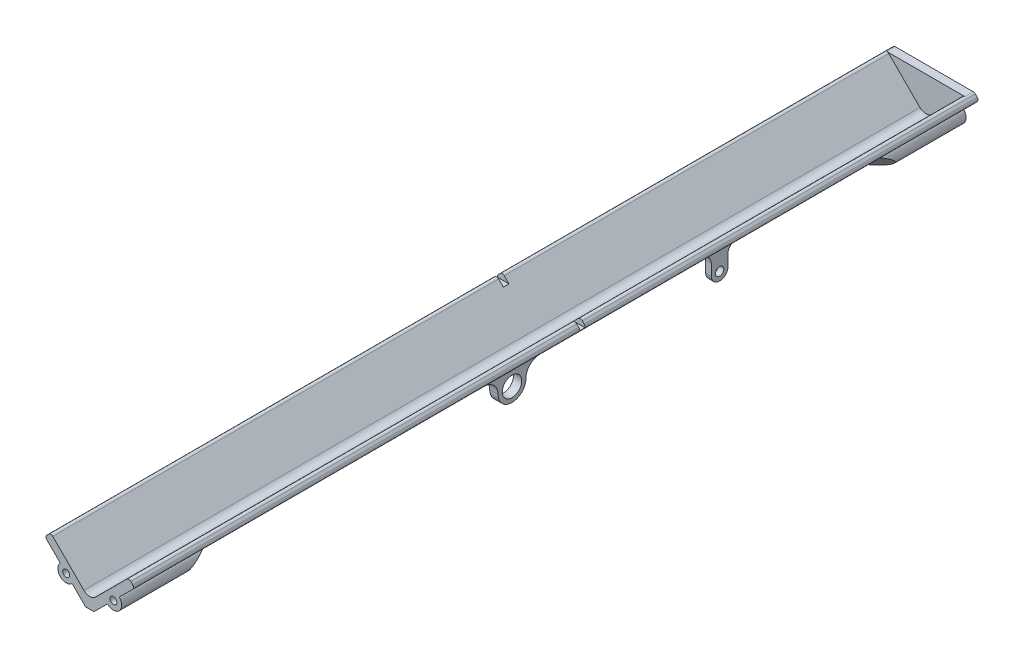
ISO-10303-21;
HEADER;
FILE_DESCRIPTION(('STEP AP214'),'2;1');
FILE_NAME('part.step','',(''),(''),'','','');
FILE_SCHEMA(('AUTOMOTIVE_DESIGN { 1 0 10303 214 1 1 1 1 }'));
ENDSEC;
DATA;
#1=APPLICATION_CONTEXT('core data for automotive mechanical design processes');
#2=APPLICATION_PROTOCOL_DEFINITION('international standard','automotive_design',2000,#1);
#3=PRODUCT_CONTEXT('',#1,'mechanical');
#4=PRODUCT('Part','Part','',(#3));
#5=PRODUCT_RELATED_PRODUCT_CATEGORY('part','',(#4));
#6=PRODUCT_DEFINITION_FORMATION('','',#4);
#7=PRODUCT_DEFINITION_CONTEXT('part definition',#1,'design');
#8=PRODUCT_DEFINITION('design','',#6,#7);
#9=PRODUCT_DEFINITION_SHAPE('','',#8);
#10=(LENGTH_UNIT() NAMED_UNIT(*) SI_UNIT(.MILLI.,.METRE.));
#11=(NAMED_UNIT(*) PLANE_ANGLE_UNIT() SI_UNIT($,.RADIAN.));
#12=(NAMED_UNIT(*) SI_UNIT($,.STERADIAN.) SOLID_ANGLE_UNIT());
#13=UNCERTAINTY_MEASURE_WITH_UNIT(LENGTH_MEASURE(1.E-05),#10,'distance_accuracy_value','');
#14=(GEOMETRIC_REPRESENTATION_CONTEXT(3) GLOBAL_UNCERTAINTY_ASSIGNED_CONTEXT((#13)) GLOBAL_UNIT_ASSIGNED_CONTEXT((#10,
#11,#12)) REPRESENTATION_CONTEXT('',''));
#15=CARTESIAN_POINT('',(0.,0.,0.));
#16=DIRECTION('',(0.,0.,1.));
#17=DIRECTION('',(1.,0.,0.));
#18=AXIS2_PLACEMENT_3D('',#15,#16,#17);
#19=CARTESIAN_POINT('',(-2.12132034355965,2.12132034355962,300.));
#20=DIRECTION('',(-0.707106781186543,-0.707106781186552,0.));
#21=DIRECTION('',(0.707106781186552,-0.707106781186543,0.));
#22=AXIS2_PLACEMENT_3D('',#19,#20,#21);
#23=PLANE('',#22);
#24=DIRECTION('',(0.707106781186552,-0.707106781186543,0.));
#25=VECTOR('',#24,1.);
#26=CARTESIAN_POINT('',(-2.12132034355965,2.12132034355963,140.));
#27=LINE('',#26,#25);
#28=CARTESIAN_POINT('',(-13.2928932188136,13.2928932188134,140.));
#29=VERTEX_POINT('',#28);
#30=CARTESIAN_POINT('',(-11.585786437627,11.5857864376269,140.));
#31=VERTEX_POINT('',#30);
#32=EDGE_CURVE('E381',#29,#31,#27,.T.);
#33=ORIENTED_EDGE('',*,*,#32,.F.);
#34=DIRECTION('',(0.,0.,-1.));
#35=VECTOR('',#34,1.);
#36=CARTESIAN_POINT('',(-13.2928932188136,13.2928932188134,300.));
#37=LINE('',#36,#35);
#38=CARTESIAN_POINT('',(-13.2928932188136,13.2928932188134,300.));
#39=VERTEX_POINT('',#38);
#40=EDGE_CURVE('E591',#39,#29,#37,.T.);
#41=ORIENTED_EDGE('',*,*,#40,.F.);
#42=DIRECTION('',(-0.707106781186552,0.707106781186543,0.));
#43=VECTOR('',#42,1.);
#44=CARTESIAN_POINT('',(-2.12132034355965,2.12132034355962,300.));
#45=LINE('',#44,#43);
#46=CARTESIAN_POINT('',(-2.12132034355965,2.12132034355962,300.));
#47=VERTEX_POINT('',#46);
#48=EDGE_CURVE('E516',#47,#39,#45,.T.);
#49=ORIENTED_EDGE('',*,*,#48,.F.);
#50=DIRECTION('',(0.,0.,-1.));
#51=VECTOR('',#50,1.);
#52=CARTESIAN_POINT('',(-2.12132034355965,2.12132034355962,300.));
#53=LINE('',#52,#51);
#54=CARTESIAN_POINT('',(-2.12132034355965,2.12132034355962,0.));
#55=VERTEX_POINT('',#54);
#56=EDGE_CURVE('E594',#47,#55,#53,.T.);
#57=ORIENTED_EDGE('',*,*,#56,.T.);
#58=DIRECTION('',(-0.707106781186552,0.707106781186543,0.));
#59=VECTOR('',#58,1.);
#60=CARTESIAN_POINT('',(-2.12132034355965,2.12132034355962,0.));
#61=LINE('',#60,#59);
#62=CARTESIAN_POINT('',(-13.2928932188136,13.2928932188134,0.));
#63=VERTEX_POINT('',#62);
#64=EDGE_CURVE('E546',#55,#63,#61,.T.);
#65=ORIENTED_EDGE('',*,*,#64,.T.);
#66=CARTESIAN_POINT('',(-13.2928932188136,13.2928932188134,138.));
#67=VERTEX_POINT('',#66);
#68=EDGE_CURVE('E361',#67,#63,#37,.T.);
#69=ORIENTED_EDGE('',*,*,#68,.F.);
#70=DIRECTION('',(-0.707106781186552,0.707106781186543,0.));
#71=VECTOR('',#70,1.);
#72=CARTESIAN_POINT('',(-2.12132034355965,2.12132034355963,138.));
#73=LINE('',#72,#71);
#74=CARTESIAN_POINT('',(-11.585786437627,11.5857864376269,138.));
#75=VERTEX_POINT('',#74);
#76=EDGE_CURVE('E352',#75,#67,#73,.T.);
#77=ORIENTED_EDGE('',*,*,#76,.F.);
#78=DIRECTION('',(0.,0.,-1.));
#79=VECTOR('',#78,1.);
#80=CARTESIAN_POINT('',(-11.5857864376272,11.5857864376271,300.));
#81=LINE('',#80,#79);
#82=EDGE_CURVE('E340',#31,#75,#81,.T.);
#83=ORIENTED_EDGE('',*,*,#82,.F.);
#84=EDGE_LOOP('',(#33,#41,#49,#57,#65,#69,#77,#83));
#85=FACE_BOUND('',#84,.T.);
#86=ADVANCED_FACE('F48',(#85),#23,.F.);
#87=CARTESIAN_POINT('',(-14.0000000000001,12.5857864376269,300.));
#88=DIRECTION('',(0.,0.,-1.));
#89=DIRECTION('',(-1.,0.,0.));
#90=AXIS2_PLACEMENT_3D('',#87,#88,#89);
#91=CYLINDRICAL_SURFACE('',#90,0.999999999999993);
#92=CARTESIAN_POINT('',(-14.0000000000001,12.5857864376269,140.));
#93=DIRECTION('',(0.,0.,-1.));
#94=DIRECTION('',(-1.,0.,0.));
#95=AXIS2_PLACEMENT_3D('',#92,#93,#94);
#96=CIRCLE('',#95,0.999999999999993);
#97=CARTESIAN_POINT('',(-14.7071067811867,13.2928932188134,140.));
#98=VERTEX_POINT('',#97);
#99=EDGE_CURVE('E379',#98,#29,#96,.T.);
#100=ORIENTED_EDGE('',*,*,#99,.F.);
#101=DIRECTION('',(0.,0.,-1.));
#102=VECTOR('',#101,1.);
#103=CARTESIAN_POINT('',(-14.7071067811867,13.2928932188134,300.));
#104=LINE('',#103,#102);
#105=CARTESIAN_POINT('',(-14.7071067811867,13.2928932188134,300.));
#106=VERTEX_POINT('',#105);
#107=EDGE_CURVE('E588',#106,#98,#104,.T.);
#108=ORIENTED_EDGE('',*,*,#107,.F.);
#109=CARTESIAN_POINT('',(-14.0000000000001,12.5857864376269,300.));
#110=DIRECTION('',(0.,0.,1.));
#111=DIRECTION('',(1.,0.,0.));
#112=AXIS2_PLACEMENT_3D('',#109,#110,#111);
#113=CIRCLE('',#112,0.999999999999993);
#114=EDGE_CURVE('E519',#39,#106,#113,.T.);
#115=ORIENTED_EDGE('',*,*,#114,.F.);
#116=ORIENTED_EDGE('',*,*,#40,.T.);
#117=EDGE_LOOP('',(#100,#108,#115,#116));
#118=FACE_BOUND('',#117,.T.);
#119=ADVANCED_FACE('F871',(#118),#91,.T.);
#120=CARTESIAN_POINT('',(-14.7071067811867,13.2928932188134,138.));
#121=VERTEX_POINT('',#120);
#122=CARTESIAN_POINT('',(-14.7071067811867,13.2928932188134,-3.));
#123=VERTEX_POINT('',#122);
#124=EDGE_CURVE('E587',#121,#123,#104,.T.);
#125=ORIENTED_EDGE('',*,*,#124,.F.);
#126=CARTESIAN_POINT('',(-14.0000000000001,12.5857864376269,138.));
#127=DIRECTION('',(0.,0.,1.));
#128=DIRECTION('',(1.,0.,0.));
#129=AXIS2_PLACEMENT_3D('',#126,#127,#128);
#130=CIRCLE('',#129,0.999999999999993);
#131=EDGE_CURVE('E363',#67,#121,#130,.T.);
#132=ORIENTED_EDGE('',*,*,#131,.F.);
#133=ORIENTED_EDGE('',*,*,#68,.T.);
#134=CARTESIAN_POINT('',(-14.0000000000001,12.5857864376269,0.));
#135=DIRECTION('',(0.,0.,1.));
#136=DIRECTION('',(1.,0.,0.));
#137=AXIS2_PLACEMENT_3D('',#134,#135,#136);
#138=CIRCLE('',#137,0.999999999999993);
#139=CARTESIAN_POINT('',(-14.0000000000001,13.5857864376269,0.));
#140=VERTEX_POINT('',#139);
#141=EDGE_CURVE('E548',#63,#140,#138,.T.);
#142=ORIENTED_EDGE('',*,*,#141,.T.);
#143=DIRECTION('',(0.,0.,1.));
#144=VECTOR('',#143,1.);
#145=CARTESIAN_POINT('',(-14.0000000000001,13.5857864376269,-3.));
#146=LINE('',#145,#144);
#147=CARTESIAN_POINT('',(-14.0000000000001,13.5857864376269,-3.));
#148=VERTEX_POINT('',#147);
#149=EDGE_CURVE('E449',#148,#140,#146,.T.);
#150=ORIENTED_EDGE('',*,*,#149,.F.);
#151=CARTESIAN_POINT('',(-14.0000000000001,12.5857864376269,-3.));
#152=DIRECTION('',(0.,0.,-1.));
#153=DIRECTION('',(-1.,0.,0.));
#154=AXIS2_PLACEMENT_3D('',#151,#152,#153);
#155=CIRCLE('',#154,0.999999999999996);
#156=EDGE_CURVE('E431',#123,#148,#155,.T.);
#157=ORIENTED_EDGE('',*,*,#156,.F.);
#158=EDGE_LOOP('',(#125,#132,#133,#142,#150,#157));
#159=FACE_BOUND('',#158,.T.);
#160=ADVANCED_FACE('F777',(#159),#91,.T.);
#161=CARTESIAN_POINT('',(-14.7071067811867,13.2928932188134,300.));
#162=DIRECTION('',(0.707106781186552,-0.707106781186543,0.));
#163=DIRECTION('',(0.707106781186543,0.707106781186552,0.));
#164=AXIS2_PLACEMENT_3D('',#161,#162,#163);
#165=PLANE('',#164);
#166=DIRECTION('',(0.707106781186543,0.707106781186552,0.));
#167=VECTOR('',#166,1.);
#168=CARTESIAN_POINT('',(-14.7071067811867,13.2928932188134,140.));
#169=LINE('',#168,#167);
#170=CARTESIAN_POINT('',(-15.4142135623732,12.5857864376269,140.));
#171=VERTEX_POINT('',#170);
#172=EDGE_CURVE('E376',#171,#98,#169,.T.);
#173=ORIENTED_EDGE('',*,*,#172,.F.);
#174=DIRECTION('',(0.,0.,-1.));
#175=VECTOR('',#174,1.);
#176=CARTESIAN_POINT('',(-15.4142135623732,12.5857864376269,300.));
#177=LINE('',#176,#175);
#178=CARTESIAN_POINT('',(-15.4142135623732,12.5857864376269,300.));
#179=VERTEX_POINT('',#178);
#180=EDGE_CURVE('E584',#179,#171,#177,.T.);
#181=ORIENTED_EDGE('',*,*,#180,.F.);
#182=DIRECTION('',(-0.707106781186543,-0.707106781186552,0.));
#183=VECTOR('',#182,1.);
#184=CARTESIAN_POINT('',(-14.7071067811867,13.2928932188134,300.));
#185=LINE('',#184,#183);
#186=EDGE_CURVE('E521',#106,#179,#185,.T.);
#187=ORIENTED_EDGE('',*,*,#186,.F.);
#188=ORIENTED_EDGE('',*,*,#107,.T.);
#189=EDGE_LOOP('',(#173,#181,#187,#188));
#190=FACE_BOUND('',#189,.T.);
#191=ADVANCED_FACE('F976',(#190),#165,.F.);
#192=DIRECTION('',(-0.707106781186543,-0.707106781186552,0.));
#193=VECTOR('',#192,1.);
#194=CARTESIAN_POINT('',(-14.7071067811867,13.2928932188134,138.));
#195=LINE('',#194,#193);
#196=CARTESIAN_POINT('',(-15.4142135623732,12.5857864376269,138.));
#197=VERTEX_POINT('',#196);
#198=EDGE_CURVE('E367',#121,#197,#195,.T.);
#199=ORIENTED_EDGE('',*,*,#198,.F.);
#200=ORIENTED_EDGE('',*,*,#124,.T.);
#201=DIRECTION('',(0.70710678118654,0.707106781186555,0.));
#202=VECTOR('',#201,1.);
#203=CARTESIAN_POINT('',(-14.7071067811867,13.2928932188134,-3.));
#204=LINE('',#203,#202);
#205=CARTESIAN_POINT('',(-15.4142135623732,12.5857864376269,-3.));
#206=VERTEX_POINT('',#205);
#207=EDGE_CURVE('E428',#206,#123,#204,.T.);
#208=ORIENTED_EDGE('',*,*,#207,.F.);
#209=EDGE_CURVE('E583',#197,#206,#177,.T.);
#210=ORIENTED_EDGE('',*,*,#209,.F.);
#211=EDGE_LOOP('',(#199,#200,#208,#210));
#212=FACE_BOUND('',#211,.T.);
#213=ADVANCED_FACE('F770',(#212),#165,.F.);
#214=CARTESIAN_POINT('',(-14.7071067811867,11.8786796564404,300.));
#215=DIRECTION('',(0.,0.,-1.));
#216=DIRECTION('',(-1.,0.,0.));
#217=AXIS2_PLACEMENT_3D('',#214,#215,#216);
#218=CYLINDRICAL_SURFACE('',#217,0.999999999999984);
#219=CARTESIAN_POINT('',(-14.7071067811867,11.8786796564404,140.));
#220=DIRECTION('',(0.,0.,-1.));
#221=DIRECTION('',(-1.,0.,0.));
#222=AXIS2_PLACEMENT_3D('',#219,#220,#221);
#223=CIRCLE('',#222,0.999999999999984);
#224=CARTESIAN_POINT('',(-15.6632519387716,11.5857864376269,140.));
#225=VERTEX_POINT('',#224);
#226=EDGE_CURVE('E374',#225,#171,#223,.T.);
#227=ORIENTED_EDGE('',*,*,#226,.F.);
#228=DIRECTION('',(0.,0.,-1.));
#229=VECTOR('',#228,1.);
#230=CARTESIAN_POINT('',(-15.6632519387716,11.5857864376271,300.));
#231=LINE('',#230,#229);
#232=CARTESIAN_POINT('',(-15.6632519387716,11.5857864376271,138.));
#233=VERTEX_POINT('',#232);
#234=EDGE_CURVE('E348',#233,#225,#231,.F.);
#235=ORIENTED_EDGE('',*,*,#234,.F.);
#236=CARTESIAN_POINT('',(-14.7071067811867,11.8786796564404,138.));
#237=DIRECTION('',(0.,0.,1.));
#238=DIRECTION('',(1.,0.,0.));
#239=AXIS2_PLACEMENT_3D('',#236,#237,#238);
#240=CIRCLE('',#239,0.999999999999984);
#241=EDGE_CURVE('E355',#197,#233,#240,.T.);
#242=ORIENTED_EDGE('',*,*,#241,.F.);
#243=ORIENTED_EDGE('',*,*,#209,.T.);
#244=CARTESIAN_POINT('',(-14.7071067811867,11.8786796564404,-3.));
#245=DIRECTION('',(0.,0.,-1.));
#246=DIRECTION('',(-1.,0.,0.));
#247=AXIS2_PLACEMENT_3D('',#244,#245,#246);
#248=CIRCLE('',#247,0.999999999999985);
#249=CARTESIAN_POINT('',(-15.4142135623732,11.1715728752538,-3.));
#250=VERTEX_POINT('',#249);
#251=EDGE_CURVE('E425',#250,#206,#248,.T.);
#252=ORIENTED_EDGE('',*,*,#251,.F.);
#253=DIRECTION('',(0.,0.,-1.));
#254=VECTOR('',#253,1.);
#255=CARTESIAN_POINT('',(-15.4142135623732,11.1715728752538,300.));
#256=LINE('',#255,#254);
#257=CARTESIAN_POINT('',(-15.4142135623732,11.1715728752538,300.));
#258=VERTEX_POINT('',#257);
#259=EDGE_CURVE('E580',#258,#250,#256,.T.);
#260=ORIENTED_EDGE('',*,*,#259,.F.);
#261=CARTESIAN_POINT('',(-14.7071067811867,11.8786796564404,300.));
#262=DIRECTION('',(0.,0.,1.));
#263=DIRECTION('',(1.,0.,0.));
#264=AXIS2_PLACEMENT_3D('',#261,#262,#263);
#265=CIRCLE('',#264,0.999999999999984);
#266=EDGE_CURVE('E523',#179,#258,#265,.T.);
#267=ORIENTED_EDGE('',*,*,#266,.F.);
#268=ORIENTED_EDGE('',*,*,#180,.T.);
#269=EDGE_LOOP('',(#227,#235,#242,#243,#252,#260,#267,#268));
#270=FACE_BOUND('',#269,.T.);
#271=ADVANCED_FACE('F767',(#270),#218,.T.);
#272=CARTESIAN_POINT('',(14.7071067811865,11.8786796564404,300.));
#273=DIRECTION('',(0.,0.,-1.));
#274=DIRECTION('',(-1.,0.,0.));
#275=AXIS2_PLACEMENT_3D('',#272,#273,#274);
#276=CYLINDRICAL_SURFACE('',#275,1.);
#277=CARTESIAN_POINT('',(14.7071067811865,11.8786796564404,140.));
#278=DIRECTION('',(0.,0.,-1.));
#279=DIRECTION('',(-1.,0.,0.));
#280=AXIS2_PLACEMENT_3D('',#277,#278,#279);
#281=CIRCLE('',#280,1.);
#282=CARTESIAN_POINT('',(15.414213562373,12.5857864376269,140.));
#283=VERTEX_POINT('',#282);
#284=CARTESIAN_POINT('',(15.6632519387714,11.5857864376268,140.));
#285=VERTEX_POINT('',#284);
#286=EDGE_CURVE('E372',#283,#285,#281,.T.);
#287=ORIENTED_EDGE('',*,*,#286,.F.);
#288=DIRECTION('',(0.,0.,-1.));
#289=VECTOR('',#288,1.);
#290=CARTESIAN_POINT('',(15.414213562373,12.5857864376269,300.));
#291=LINE('',#290,#289);
#292=CARTESIAN_POINT('',(15.414213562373,12.5857864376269,300.));
#293=VERTEX_POINT('',#292);
#294=EDGE_CURVE('E566',#293,#283,#291,.T.);
#295=ORIENTED_EDGE('',*,*,#294,.F.);
#296=CARTESIAN_POINT('',(14.7071067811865,11.8786796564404,300.));
#297=DIRECTION('',(0.,0.,1.));
#298=DIRECTION('',(-1.,0.,0.));
#299=AXIS2_PLACEMENT_3D('',#296,#297,#298);
#300=CIRCLE('',#299,1.);
#301=CARTESIAN_POINT('',(15.414213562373,11.1715728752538,300.));
#302=VERTEX_POINT('',#301);
#303=EDGE_CURVE('E535',#302,#293,#300,.T.);
#304=ORIENTED_EDGE('',*,*,#303,.F.);
#305=DIRECTION('',(0.,0.,-1.));
#306=VECTOR('',#305,1.);
#307=CARTESIAN_POINT('',(15.414213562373,11.1715728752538,300.));
#308=LINE('',#307,#306);
#309=CARTESIAN_POINT('',(15.414213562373,11.1715728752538,-3.));
#310=VERTEX_POINT('',#309);
#311=EDGE_CURVE('E569',#302,#310,#308,.T.);
#312=ORIENTED_EDGE('',*,*,#311,.T.);
#313=CARTESIAN_POINT('',(14.7071067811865,11.8786796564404,-3.));
#314=DIRECTION('',(0.,0.,-1.));
#315=DIRECTION('',(-1.,0.,0.));
#316=AXIS2_PLACEMENT_3D('',#313,#314,#315);
#317=CIRCLE('',#316,1.);
#318=CARTESIAN_POINT('',(15.414213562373,12.5857864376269,-3.));
#319=VERTEX_POINT('',#318);
#320=EDGE_CURVE('E441',#319,#310,#317,.T.);
#321=ORIENTED_EDGE('',*,*,#320,.F.);
#322=CARTESIAN_POINT('',(15.414213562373,12.5857864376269,138.));
#323=VERTEX_POINT('',#322);
#324=EDGE_CURVE('E565',#323,#319,#291,.T.);
#325=ORIENTED_EDGE('',*,*,#324,.F.);
#326=CARTESIAN_POINT('',(14.7071067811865,11.8786796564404,138.));
#327=DIRECTION('',(0.,0.,1.));
#328=DIRECTION('',(1.,0.,0.));
#329=AXIS2_PLACEMENT_3D('',#326,#327,#328);
#330=CIRCLE('',#329,1.);
#331=CARTESIAN_POINT('',(15.6632519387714,11.5857864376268,138.));
#332=VERTEX_POINT('',#331);
#333=EDGE_CURVE('E759',#332,#323,#330,.T.);
#334=ORIENTED_EDGE('',*,*,#333,.F.);
#335=DIRECTION('',(0.,0.,-1.));
#336=VECTOR('',#335,1.);
#337=CARTESIAN_POINT('',(15.6632519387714,11.5857864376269,300.));
#338=LINE('',#337,#336);
#339=EDGE_CURVE('E357',#285,#332,#338,.T.);
#340=ORIENTED_EDGE('',*,*,#339,.F.);
#341=EDGE_LOOP('',(#287,#295,#304,#312,#321,#325,#334,#340));
#342=FACE_BOUND('',#341,.T.);
#343=ADVANCED_FACE('F794',(#342),#276,.T.);
#344=CARTESIAN_POINT('',(14.7071067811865,13.2928932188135,300.));
#345=DIRECTION('',(-0.707106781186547,-0.707106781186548,0.));
#346=DIRECTION('',(0.707106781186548,-0.707106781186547,0.));
#347=AXIS2_PLACEMENT_3D('',#344,#345,#346);
#348=PLANE('',#347);
#349=DIRECTION('',(0.707106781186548,-0.707106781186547,0.));
#350=VECTOR('',#349,1.);
#351=CARTESIAN_POINT('',(14.7071067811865,13.2928932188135,140.));
#352=LINE('',#351,#350);
#353=CARTESIAN_POINT('',(14.7071067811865,13.2928932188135,140.));
#354=VERTEX_POINT('',#353);
#355=EDGE_CURVE('E365',#354,#283,#352,.T.);
#356=ORIENTED_EDGE('',*,*,#355,.F.);
#357=DIRECTION('',(0.,0.,-1.));
#358=VECTOR('',#357,1.);
#359=CARTESIAN_POINT('',(14.7071067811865,13.2928932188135,300.));
#360=LINE('',#359,#358);
#361=CARTESIAN_POINT('',(14.7071067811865,13.2928932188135,300.));
#362=VERTEX_POINT('',#361);
#363=EDGE_CURVE('E562',#362,#354,#360,.T.);
#364=ORIENTED_EDGE('',*,*,#363,.F.);
#365=DIRECTION('',(-0.707106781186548,0.707106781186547,0.));
#366=VECTOR('',#365,1.);
#367=CARTESIAN_POINT('',(14.7071067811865,13.2928932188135,300.));
#368=LINE('',#367,#366);
#369=EDGE_CURVE('E537',#293,#362,#368,.T.);
#370=ORIENTED_EDGE('',*,*,#369,.F.);
#371=ORIENTED_EDGE('',*,*,#294,.T.);
#372=EDGE_LOOP('',(#356,#364,#370,#371));
#373=FACE_BOUND('',#372,.T.);
#374=ADVANCED_FACE('F958',(#373),#348,.F.);
#375=DIRECTION('',(-0.707106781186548,0.707106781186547,0.));
#376=VECTOR('',#375,1.);
#377=CARTESIAN_POINT('',(14.7071067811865,13.2928932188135,138.));
#378=LINE('',#377,#376);
#379=CARTESIAN_POINT('',(14.7071067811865,13.2928932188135,138.));
#380=VERTEX_POINT('',#379);
#381=EDGE_CURVE('E757',#323,#380,#378,.T.);
#382=ORIENTED_EDGE('',*,*,#381,.F.);
#383=ORIENTED_EDGE('',*,*,#324,.T.);
#384=DIRECTION('',(0.707106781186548,-0.707106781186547,0.));
#385=VECTOR('',#384,1.);
#386=CARTESIAN_POINT('',(15.414213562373,12.5857864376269,-3.));
#387=LINE('',#386,#385);
#388=CARTESIAN_POINT('',(14.7071067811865,13.2928932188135,-3.));
#389=VERTEX_POINT('',#388);
#390=EDGE_CURVE('E438',#389,#319,#387,.T.);
#391=ORIENTED_EDGE('',*,*,#390,.F.);
#392=EDGE_CURVE('E561',#380,#389,#360,.T.);
#393=ORIENTED_EDGE('',*,*,#392,.F.);
#394=EDGE_LOOP('',(#382,#383,#391,#393));
#395=FACE_BOUND('',#394,.T.);
#396=ADVANCED_FACE('F791',(#395),#348,.F.);
#397=CARTESIAN_POINT('',(14.,12.5857864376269,300.));
#398=DIRECTION('',(0.,0.,-1.));
#399=DIRECTION('',(-1.,0.,0.));
#400=AXIS2_PLACEMENT_3D('',#397,#398,#399);
#401=CYLINDRICAL_SURFACE('',#400,1.);
#402=ORIENTED_EDGE('',*,*,#363,.T.);
#403=CARTESIAN_POINT('',(14.,12.5857864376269,140.));
#404=DIRECTION('',(0.,0.,-1.));
#405=DIRECTION('',(-1.,0.,0.));
#406=AXIS2_PLACEMENT_3D('',#403,#404,#405);
#407=CIRCLE('',#406,1.);
#408=CARTESIAN_POINT('',(13.2928932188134,13.2928932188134,140.));
#409=VERTEX_POINT('',#408);
#410=EDGE_CURVE('E362',#409,#354,#407,.T.);
#411=ORIENTED_EDGE('',*,*,#410,.F.);
#412=DIRECTION('',(0.,0.,-1.));
#413=VECTOR('',#412,1.);
#414=CARTESIAN_POINT('',(13.2928932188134,13.2928932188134,300.));
#415=LINE('',#414,#413);
#416=CARTESIAN_POINT('',(13.2928932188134,13.2928932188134,300.));
#417=VERTEX_POINT('',#416);
#418=EDGE_CURVE('E558',#417,#409,#415,.T.);
#419=ORIENTED_EDGE('',*,*,#418,.F.);
#420=CARTESIAN_POINT('',(14.,12.5857864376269,300.));
#421=DIRECTION('',(0.,0.,1.));
#422=DIRECTION('',(-1.,0.,0.));
#423=AXIS2_PLACEMENT_3D('',#420,#421,#422);
#424=CIRCLE('',#423,1.);
#425=EDGE_CURVE('E539',#362,#417,#424,.T.);
#426=ORIENTED_EDGE('',*,*,#425,.F.);
#427=EDGE_LOOP('',(#402,#411,#419,#426));
#428=FACE_BOUND('',#427,.T.);
#429=ADVANCED_FACE('F962',(#428),#401,.T.);
#430=CARTESIAN_POINT('',(14.,12.5857864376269,138.));
#431=DIRECTION('',(0.,0.,1.));
#432=DIRECTION('',(1.,0.,0.));
#433=AXIS2_PLACEMENT_3D('',#430,#431,#432);
#434=CIRCLE('',#433,1.);
#435=CARTESIAN_POINT('',(13.2928932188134,13.2928932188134,138.));
#436=VERTEX_POINT('',#435);
#437=EDGE_CURVE('E347',#380,#436,#434,.T.);
#438=ORIENTED_EDGE('',*,*,#437,.F.);
#439=ORIENTED_EDGE('',*,*,#392,.T.);
#440=CARTESIAN_POINT('',(14.,12.5857864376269,-3.));
#441=DIRECTION('',(0.,0.,-1.));
#442=DIRECTION('',(-1.,0.,0.));
#443=AXIS2_PLACEMENT_3D('',#440,#441,#442);
#444=CIRCLE('',#443,1.);
#445=CARTESIAN_POINT('',(14.,13.5857864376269,-3.));
#446=VERTEX_POINT('',#445);
#447=EDGE_CURVE('E435',#446,#389,#444,.T.);
#448=ORIENTED_EDGE('',*,*,#447,.F.);
#449=DIRECTION('',(0.,0.,1.));
#450=VECTOR('',#449,1.);
#451=CARTESIAN_POINT('',(14.,13.5857864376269,-3.));
#452=LINE('',#451,#450);
#453=CARTESIAN_POINT('',(14.,13.5857864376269,0.));
#454=VERTEX_POINT('',#453);
#455=EDGE_CURVE('E444',#446,#454,#452,.T.);
#456=ORIENTED_EDGE('',*,*,#455,.T.);
#457=CARTESIAN_POINT('',(14.,12.5857864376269,0.));
#458=DIRECTION('',(0.,0.,1.));
#459=DIRECTION('',(-1.,0.,0.));
#460=AXIS2_PLACEMENT_3D('',#457,#458,#459);
#461=CIRCLE('',#460,1.);
#462=CARTESIAN_POINT('',(13.2928932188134,13.2928932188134,0.));
#463=VERTEX_POINT('',#462);
#464=EDGE_CURVE('E551',#454,#463,#461,.T.);
#465=ORIENTED_EDGE('',*,*,#464,.T.);
#466=EDGE_CURVE('E557',#436,#463,#415,.T.);
#467=ORIENTED_EDGE('',*,*,#466,.F.);
#468=EDGE_LOOP('',(#438,#439,#448,#456,#465,#467));
#469=FACE_BOUND('',#468,.T.);
#470=ADVANCED_FACE('F1051',(#469),#401,.T.);
#471=CARTESIAN_POINT('',(2.12132034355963,2.12132034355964,300.));
#472=DIRECTION('',(0.707106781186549,-0.707106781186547,0.));
#473=DIRECTION('',(0.707106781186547,0.707106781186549,0.));
#474=AXIS2_PLACEMENT_3D('',#471,#472,#473);
#475=PLANE('',#474);
#476=DIRECTION('',(0.707106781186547,0.707106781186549,0.));
#477=VECTOR('',#476,1.);
#478=CARTESIAN_POINT('',(2.12132034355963,2.12132034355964,140.));
#479=LINE('',#478,#477);
#480=CARTESIAN_POINT('',(11.5857864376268,11.5857864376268,140.));
#481=VERTEX_POINT('',#480);
#482=EDGE_CURVE('E12',#481,#409,#479,.T.);
#483=ORIENTED_EDGE('',*,*,#482,.F.);
#484=DIRECTION('',(0.,0.,1.));
#485=VECTOR('',#484,1.);
#486=CARTESIAN_POINT('',(11.5857864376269,11.585786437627,300.));
#487=LINE('',#486,#485);
#488=CARTESIAN_POINT('',(11.5857864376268,11.5857864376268,138.));
#489=VERTEX_POINT('',#488);
#490=EDGE_CURVE('E732',#489,#481,#487,.T.);
#491=ORIENTED_EDGE('',*,*,#490,.F.);
#492=DIRECTION('',(-0.707106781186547,-0.707106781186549,0.));
#493=VECTOR('',#492,1.);
#494=CARTESIAN_POINT('',(2.12132034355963,2.12132034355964,138.));
#495=LINE('',#494,#493);
#496=EDGE_CURVE('E57',#436,#489,#495,.T.);
#497=ORIENTED_EDGE('',*,*,#496,.F.);
#498=ORIENTED_EDGE('',*,*,#466,.T.);
#499=DIRECTION('',(-0.707106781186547,-0.707106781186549,0.));
#500=VECTOR('',#499,1.);
#501=CARTESIAN_POINT('',(2.12132034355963,2.12132034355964,0.));
#502=LINE('',#501,#500);
#503=CARTESIAN_POINT('',(2.12132034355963,2.12132034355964,0.));
#504=VERTEX_POINT('',#503);
#505=EDGE_CURVE('E517',#463,#504,#502,.T.);
#506=ORIENTED_EDGE('',*,*,#505,.T.);
#507=DIRECTION('',(0.,0.,-1.));
#508=VECTOR('',#507,1.);
#509=CARTESIAN_POINT('',(2.12132034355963,2.12132034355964,300.));
#510=LINE('',#509,#508);
#511=CARTESIAN_POINT('',(2.12132034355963,2.12132034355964,300.));
#512=VERTEX_POINT('',#511);
#513=EDGE_CURVE('E543',#512,#504,#510,.T.);
#514=ORIENTED_EDGE('',*,*,#513,.F.);
#515=DIRECTION('',(-0.707106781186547,-0.707106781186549,0.));
#516=VECTOR('',#515,1.);
#517=CARTESIAN_POINT('',(2.12132034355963,2.12132034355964,300.));
#518=LINE('',#517,#516);
#519=EDGE_CURVE('E541',#417,#512,#518,.T.);
#520=ORIENTED_EDGE('',*,*,#519,.F.);
#521=ORIENTED_EDGE('',*,*,#418,.T.);
#522=EDGE_LOOP('',(#483,#491,#497,#498,#506,#514,#520,#521));
#523=FACE_BOUND('',#522,.T.);
#524=ADVANCED_FACE('F742',(#523),#475,.F.);
#525=CARTESIAN_POINT('',(1.50000000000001,-2.74264068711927,300.));
#526=DIRECTION('',(0.,1.,0.));
#527=DIRECTION('',(-1.,0.,0.));
#528=AXIS2_PLACEMENT_3D('',#525,#526,#527);
#529=PLANE('',#528);
#530=DIRECTION('',(-1.,0.,0.));
#531=VECTOR('',#530,1.);
#532=CARTESIAN_POINT('',(0.999999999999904,-2.74264068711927,81.));
#533=LINE('',#532,#531);
#534=CARTESIAN_POINT('',(-1.49999999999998,-2.74264068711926,81.));
#535=VERTEX_POINT('',#534);
#536=CARTESIAN_POINT('',(1.50000000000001,-2.74264068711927,81.));
#537=VERTEX_POINT('',#536);
#538=EDGE_CURVE('E635',#535,#537,#533,.F.);
#539=ORIENTED_EDGE('',*,*,#538,.T.);
#540=DIRECTION('',(0.,0.,-1.));
#541=VECTOR('',#540,1.);
#542=CARTESIAN_POINT('',(1.50000000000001,-2.74264068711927,300.));
#543=LINE('',#542,#541);
#544=CARTESIAN_POINT('',(1.50000000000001,-2.74264068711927,140.));
#545=VERTEX_POINT('',#544);
#546=EDGE_CURVE('E576',#545,#537,#543,.T.);
#547=ORIENTED_EDGE('',*,*,#546,.F.);
#548=DIRECTION('',(1.,0.,0.));
#549=VECTOR('',#548,1.);
#550=CARTESIAN_POINT('',(-1.49999999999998,-2.74264068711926,140.));
#551=LINE('',#550,#549);
#552=CARTESIAN_POINT('',(-1.50000000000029,-2.74264068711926,140.));
#553=VERTEX_POINT('',#552);
#554=EDGE_CURVE('E606',#545,#553,#551,.F.);
#555=ORIENTED_EDGE('',*,*,#554,.T.);
#556=DIRECTION('',(0.,0.,-1.));
#557=VECTOR('',#556,1.);
#558=CARTESIAN_POINT('',(-1.49999999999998,-2.74264068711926,300.));
#559=LINE('',#558,#557);
#560=EDGE_CURVE('E581',#553,#535,#559,.T.);
#561=ORIENTED_EDGE('',*,*,#560,.T.);
#562=EDGE_LOOP('',(#539,#547,#555,#561));
#563=FACE_BOUND('',#562,.T.);
#564=ADVANCED_FACE('F829',(#563),#529,.F.);
#565=CARTESIAN_POINT('',(1.50000000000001,-2.74264068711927,69.));
#566=VERTEX_POINT('',#565);
#567=CARTESIAN_POINT('',(1.50000000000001,-2.74264068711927,-3.));
#568=VERTEX_POINT('',#567);
#569=EDGE_CURVE('E571',#566,#568,#543,.T.);
#570=ORIENTED_EDGE('',*,*,#569,.F.);
#571=DIRECTION('',(1.,0.,0.));
#572=VECTOR('',#571,1.);
#573=CARTESIAN_POINT('',(-1.00000000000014,-2.74264068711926,69.));
#574=LINE('',#573,#572);
#575=CARTESIAN_POINT('',(-1.49999999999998,-2.74264068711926,69.));
#576=VERTEX_POINT('',#575);
#577=EDGE_CURVE('E633',#566,#576,#574,.F.);
#578=ORIENTED_EDGE('',*,*,#577,.T.);
#579=CARTESIAN_POINT('',(-1.49999999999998,-2.74264068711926,-3.));
#580=VERTEX_POINT('',#579);
#581=EDGE_CURVE('E575',#576,#580,#559,.T.);
#582=ORIENTED_EDGE('',*,*,#581,.T.);
#583=DIRECTION('',(-1.,0.,0.));
#584=VECTOR('',#583,1.);
#585=CARTESIAN_POINT('',(1.50000000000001,-2.74264068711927,-3.));
#586=LINE('',#585,#584);
#587=EDGE_CURVE('E417',#568,#580,#586,.T.);
#588=ORIENTED_EDGE('',*,*,#587,.F.);
#589=EDGE_LOOP('',(#570,#578,#582,#588));
#590=FACE_BOUND('',#589,.T.);
#591=ADVANCED_FACE('F818',(#590),#529,.F.);
#592=CARTESIAN_POINT('',(-1.49999999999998,-2.74264068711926,300.));
#593=VERTEX_POINT('',#592);
#594=CARTESIAN_POINT('',(-1.49999999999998,-2.74264068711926,160.));
#595=VERTEX_POINT('',#594);
#596=EDGE_CURVE('E577',#593,#595,#559,.T.);
#597=ORIENTED_EDGE('',*,*,#596,.T.);
#598=DIRECTION('',(-1.,0.,0.));
#599=VECTOR('',#598,1.);
#600=CARTESIAN_POINT('',(1.50000000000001,-2.74264068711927,160.));
#601=LINE('',#600,#599);
#602=CARTESIAN_POINT('',(1.50000000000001,-2.74264068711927,160.));
#603=VERTEX_POINT('',#602);
#604=EDGE_CURVE('E609',#595,#603,#601,.F.);
#605=ORIENTED_EDGE('',*,*,#604,.T.);
#606=CARTESIAN_POINT('',(1.50000000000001,-2.74264068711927,300.));
#607=VERTEX_POINT('',#606);
#608=EDGE_CURVE('E572',#607,#603,#543,.T.);
#609=ORIENTED_EDGE('',*,*,#608,.F.);
#610=DIRECTION('',(1.,0.,0.));
#611=VECTOR('',#610,1.);
#612=CARTESIAN_POINT('',(1.50000000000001,-2.74264068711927,300.));
#613=LINE('',#612,#611);
#614=EDGE_CURVE('E529',#593,#607,#613,.T.);
#615=ORIENTED_EDGE('',*,*,#614,.F.);
#616=EDGE_LOOP('',(#597,#605,#609,#615));
#617=FACE_BOUND('',#616,.T.);
#618=ADVANCED_FACE('F885',(#617),#529,.F.);
#619=CARTESIAN_POINT('',(0.,4.24264068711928,300.));
#620=DIRECTION('',(0.,0.,-1.));
#621=DIRECTION('',(-1.,0.,0.));
#622=AXIS2_PLACEMENT_3D('',#619,#620,#621);
#623=CYLINDRICAL_SURFACE('',#622,3.);
#624=CARTESIAN_POINT('',(0.,4.24264068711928,0.));
#625=DIRECTION('',(0.,0.,-1.));
#626=DIRECTION('',(1.,0.,0.));
#627=AXIS2_PLACEMENT_3D('',#624,#625,#626);
#628=CIRCLE('',#627,3.);
#629=EDGE_CURVE('E512',#504,#55,#628,.T.);
#630=ORIENTED_EDGE('',*,*,#629,.T.);
#631=ORIENTED_EDGE('',*,*,#56,.F.);
#632=CARTESIAN_POINT('',(0.,4.24264068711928,300.));
#633=DIRECTION('',(0.,0.,-1.));
#634=DIRECTION('',(1.,0.,0.));
#635=AXIS2_PLACEMENT_3D('',#632,#633,#634);
#636=CIRCLE('',#635,3.);
#637=EDGE_CURVE('E513',#512,#47,#636,.T.);
#638=ORIENTED_EDGE('',*,*,#637,.F.);
#639=ORIENTED_EDGE('',*,*,#513,.T.);
#640=EDGE_LOOP('',(#630,#631,#638,#639));
#641=FACE_BOUND('',#640,.T.);
#642=ADVANCED_FACE('F881',(#641),#623,.F.);
#643=CARTESIAN_POINT('',(-15.4142135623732,11.1715728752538,300.));
#644=DIRECTION('',(0.707106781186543,0.707106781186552,0.));
#645=DIRECTION('',(-0.707106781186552,0.707106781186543,0.));
#646=AXIS2_PLACEMENT_3D('',#643,#644,#645);
#647=PLANE('',#646);
#648=ORIENTED_EDGE('',*,*,#259,.T.);
#649=DIRECTION('',(-0.707106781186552,0.707106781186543,0.));
#650=VECTOR('',#649,1.);
#651=CARTESIAN_POINT('',(-1.49999999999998,-2.74264068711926,-3.));
#652=LINE('',#651,#650);
#653=CARTESIAN_POINT('',(-10.5784271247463,6.33578643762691,-3.));
#654=VERTEX_POINT('',#653);
#655=EDGE_CURVE('E421',#654,#250,#652,.T.);
#656=ORIENTED_EDGE('',*,*,#655,.F.);
#657=DIRECTION('',(0.,0.,-1.));
#658=VECTOR('',#657,1.);
#659=CARTESIAN_POINT('',(-10.5784271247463,6.33578643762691,27.));
#660=LINE('',#659,#658);
#661=CARTESIAN_POINT('',(-10.5784271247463,6.33578643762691,27.));
#662=VERTEX_POINT('',#661);
#663=EDGE_CURVE('E398',#654,#662,#660,.F.);
#664=ORIENTED_EDGE('',*,*,#663,.T.);
#665=DIRECTION('',(-0.707106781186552,0.707106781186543,0.));
#666=VECTOR('',#665,1.);
#667=CARTESIAN_POINT('',(-15.4142135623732,11.1715728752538,27.));
#668=LINE('',#667,#666);
#669=CARTESIAN_POINT('',(-6.33578643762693,2.09314575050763,27.));
#670=VERTEX_POINT('',#669);
#671=EDGE_CURVE('E726',#670,#662,#668,.T.);
#672=ORIENTED_EDGE('',*,*,#671,.F.);
#673=DIRECTION('',(0.,0.,-1.));
#674=VECTOR('',#673,1.);
#675=CARTESIAN_POINT('',(-6.33578643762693,2.09314575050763,27.));
#676=LINE('',#675,#674);
#677=CARTESIAN_POINT('',(-6.33578643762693,2.09314575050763,-3.));
#678=VERTEX_POINT('',#677);
#679=EDGE_CURVE('E402',#670,#678,#676,.T.);
#680=ORIENTED_EDGE('',*,*,#679,.T.);
#681=EDGE_CURVE('E422',#580,#678,#652,.T.);
#682=ORIENTED_EDGE('',*,*,#681,.F.);
#683=ORIENTED_EDGE('',*,*,#581,.F.);
#684=EDGE_CURVE('E823',#535,#576,#559,.T.);
#685=ORIENTED_EDGE('',*,*,#684,.F.);
#686=ORIENTED_EDGE('',*,*,#560,.F.);
#687=DIRECTION('',(0.,0.,-1.));
#688=VECTOR('',#687,1.);
#689=CARTESIAN_POINT('',(-1.50000000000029,-2.74264068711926,145.));
#690=LINE('',#689,#688);
#691=EDGE_CURVE('E510',#595,#553,#690,.T.);
#692=ORIENTED_EDGE('',*,*,#691,.F.);
#693=ORIENTED_EDGE('',*,*,#596,.F.);
#694=DIRECTION('',(0.707106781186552,-0.707106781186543,0.));
#695=VECTOR('',#694,1.);
#696=CARTESIAN_POINT('',(-15.4142135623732,11.1715728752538,300.));
#697=LINE('',#696,#695);
#698=CARTESIAN_POINT('',(-6.33578643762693,2.09314575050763,300.));
#699=VERTEX_POINT('',#698);
#700=EDGE_CURVE('E525',#699,#593,#697,.T.);
#701=ORIENTED_EDGE('',*,*,#700,.F.);
#702=DIRECTION('',(0.,0.,1.));
#703=VECTOR('',#702,1.);
#704=CARTESIAN_POINT('',(-6.33578643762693,2.09314575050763,270.));
#705=LINE('',#704,#703);
#706=CARTESIAN_POINT('',(-6.33578643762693,2.09314575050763,270.));
#707=VERTEX_POINT('',#706);
#708=EDGE_CURVE('E473',#699,#707,#705,.F.);
#709=ORIENTED_EDGE('',*,*,#708,.T.);
#710=DIRECTION('',(0.707106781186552,-0.707106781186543,0.));
#711=VECTOR('',#710,1.);
#712=CARTESIAN_POINT('',(-15.4142135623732,11.1715728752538,270.));
#713=LINE('',#712,#711);
#714=CARTESIAN_POINT('',(-10.5784271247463,6.33578643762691,270.));
#715=VERTEX_POINT('',#714);
#716=EDGE_CURVE('E661',#715,#707,#713,.T.);
#717=ORIENTED_EDGE('',*,*,#716,.F.);
#718=DIRECTION('',(0.,0.,1.));
#719=VECTOR('',#718,1.);
#720=CARTESIAN_POINT('',(-10.5784271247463,6.33578643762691,270.));
#721=LINE('',#720,#719);
#722=CARTESIAN_POINT('',(-10.5784271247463,6.33578643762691,300.));
#723=VERTEX_POINT('',#722);
#724=EDGE_CURVE('E476',#715,#723,#721,.T.);
#725=ORIENTED_EDGE('',*,*,#724,.T.);
#726=EDGE_CURVE('E526',#258,#723,#697,.T.);
#727=ORIENTED_EDGE('',*,*,#726,.F.);
#728=EDGE_LOOP('',(#648,#656,#664,#672,#680,#682,#683,#685,#686,#692,#693,#701,#709,#717,#725,#727));
#729=FACE_BOUND('',#728,.T.);
#730=ADVANCED_FACE('F884',(#729),#647,.F.);
#731=CARTESIAN_POINT('',(15.414213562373,11.1715728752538,300.));
#732=DIRECTION('',(-0.707106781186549,0.707106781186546,0.));
#733=DIRECTION('',(-0.707106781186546,-0.707106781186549,0.));
#734=AXIS2_PLACEMENT_3D('',#731,#732,#733);
#735=PLANE('',#734);
#736=DIRECTION('',(0.,0.,-1.));
#737=VECTOR('',#736,1.);
#738=CARTESIAN_POINT('',(6.33578643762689,2.09314575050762,27.));
#739=LINE('',#738,#737);
#740=CARTESIAN_POINT('',(6.33578643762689,2.09314575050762,-3.));
#741=VERTEX_POINT('',#740);
#742=CARTESIAN_POINT('',(6.33578643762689,2.09314575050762,27.));
#743=VERTEX_POINT('',#742);
#744=EDGE_CURVE('E405',#741,#743,#739,.F.);
#745=ORIENTED_EDGE('',*,*,#744,.T.);
#746=DIRECTION('',(-0.707106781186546,-0.707106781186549,0.));
#747=VECTOR('',#746,1.);
#748=CARTESIAN_POINT('',(15.414213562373,11.1715728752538,27.));
#749=LINE('',#748,#747);
#750=CARTESIAN_POINT('',(10.5784271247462,6.33578643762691,27.));
#751=VERTEX_POINT('',#750);
#752=EDGE_CURVE('E411',#751,#743,#749,.T.);
#753=ORIENTED_EDGE('',*,*,#752,.F.);
#754=DIRECTION('',(0.,0.,-1.));
#755=VECTOR('',#754,1.);
#756=CARTESIAN_POINT('',(10.5784271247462,6.33578643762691,27.));
#757=LINE('',#756,#755);
#758=CARTESIAN_POINT('',(10.5784271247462,6.33578643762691,-3.));
#759=VERTEX_POINT('',#758);
#760=EDGE_CURVE('E408',#751,#759,#757,.T.);
#761=ORIENTED_EDGE('',*,*,#760,.T.);
#762=DIRECTION('',(-0.707106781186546,-0.707106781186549,0.));
#763=VECTOR('',#762,1.);
#764=CARTESIAN_POINT('',(15.414213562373,11.1715728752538,-3.));
#765=LINE('',#764,#763);
#766=EDGE_CURVE('E414',#310,#759,#765,.T.);
#767=ORIENTED_EDGE('',*,*,#766,.F.);
#768=ORIENTED_EDGE('',*,*,#311,.F.);
#769=DIRECTION('',(0.707106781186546,0.707106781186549,0.));
#770=VECTOR('',#769,1.);
#771=CARTESIAN_POINT('',(15.414213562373,11.1715728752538,300.));
#772=LINE('',#771,#770);
#773=CARTESIAN_POINT('',(10.5784271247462,6.33578643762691,300.));
#774=VERTEX_POINT('',#773);
#775=EDGE_CURVE('E531',#774,#302,#772,.T.);
#776=ORIENTED_EDGE('',*,*,#775,.F.);
#777=DIRECTION('',(0.,0.,1.));
#778=VECTOR('',#777,1.);
#779=CARTESIAN_POINT('',(10.5784271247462,6.33578643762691,270.));
#780=LINE('',#779,#778);
#781=CARTESIAN_POINT('',(10.5784271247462,6.33578643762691,270.));
#782=VERTEX_POINT('',#781);
#783=EDGE_CURVE('E466',#774,#782,#780,.F.);
#784=ORIENTED_EDGE('',*,*,#783,.T.);
#785=DIRECTION('',(0.707106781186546,0.707106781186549,0.));
#786=VECTOR('',#785,1.);
#787=CARTESIAN_POINT('',(15.414213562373,11.1715728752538,270.));
#788=LINE('',#787,#786);
#789=CARTESIAN_POINT('',(6.33578643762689,2.09314575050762,270.));
#790=VERTEX_POINT('',#789);
#791=EDGE_CURVE('E479',#790,#782,#788,.T.);
#792=ORIENTED_EDGE('',*,*,#791,.F.);
#793=DIRECTION('',(0.,0.,1.));
#794=VECTOR('',#793,1.);
#795=CARTESIAN_POINT('',(6.33578643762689,2.09314575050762,270.));
#796=LINE('',#795,#794);
#797=CARTESIAN_POINT('',(6.33578643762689,2.09314575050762,300.));
#798=VERTEX_POINT('',#797);
#799=EDGE_CURVE('E470',#790,#798,#796,.T.);
#800=ORIENTED_EDGE('',*,*,#799,.T.);
#801=EDGE_CURVE('E532',#607,#798,#772,.T.);
#802=ORIENTED_EDGE('',*,*,#801,.F.);
#803=ORIENTED_EDGE('',*,*,#608,.T.);
#804=DIRECTION('',(0.,0.,1.));
#805=VECTOR('',#804,1.);
#806=CARTESIAN_POINT('',(1.50000000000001,-2.74264068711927,145.));
#807=LINE('',#806,#805);
#808=EDGE_CURVE('E508',#545,#603,#807,.T.);
#809=ORIENTED_EDGE('',*,*,#808,.F.);
#810=ORIENTED_EDGE('',*,*,#546,.T.);
#811=EDGE_CURVE('E815',#537,#566,#543,.T.);
#812=ORIENTED_EDGE('',*,*,#811,.T.);
#813=ORIENTED_EDGE('',*,*,#569,.T.);
#814=EDGE_CURVE('E418',#741,#568,#765,.T.);
#815=ORIENTED_EDGE('',*,*,#814,.F.);
#816=EDGE_LOOP('',(#745,#753,#761,#767,#768,#776,#784,#792,#800,#802,#803,#809,#810,#812,#813,#815));
#817=FACE_BOUND('',#816,.T.);
#818=ADVANCED_FACE('F799',(#817),#735,.F.);
#819=CARTESIAN_POINT('',(0.,4.24264068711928,300.));
#820=DIRECTION('',(0.,0.,1.));
#821=DIRECTION('',(1.,0.,0.));
#822=AXIS2_PLACEMENT_3D('',#819,#820,#821);
#823=PLANE('',#822);
#824=CARTESIAN_POINT('',(-8.4571067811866,4.21446609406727,300.));
#825=DIRECTION('',(0.,0.,1.));
#826=DIRECTION('',(1.,0.,0.));
#827=AXIS2_PLACEMENT_3D('',#824,#825,#826);
#828=CIRCLE('',#827,1.25);
#829=CARTESIAN_POINT('',(-7.2071067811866,4.21446609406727,300.));
#830=VERTEX_POINT('',#829);
#831=EDGE_CURVE('E456',#830,#830,#828,.T.);
#832=ORIENTED_EDGE('',*,*,#831,.F.);
#833=EDGE_LOOP('',(#832));
#834=FACE_BOUND('',#833,.T.);
#835=CARTESIAN_POINT('',(8.45710678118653,4.21446609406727,300.));
#836=DIRECTION('',(0.,0.,1.));
#837=DIRECTION('',(1.,0.,0.));
#838=AXIS2_PLACEMENT_3D('',#835,#836,#837);
#839=CIRCLE('',#838,1.25);
#840=CARTESIAN_POINT('',(9.70710678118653,4.21446609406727,300.));
#841=VERTEX_POINT('',#840);
#842=EDGE_CURVE('E459',#841,#841,#839,.T.);
#843=ORIENTED_EDGE('',*,*,#842,.F.);
#844=EDGE_LOOP('',(#843));
#845=FACE_BOUND('',#844,.T.);
#846=ORIENTED_EDGE('',*,*,#48,.T.);
#847=ORIENTED_EDGE('',*,*,#114,.T.);
#848=ORIENTED_EDGE('',*,*,#186,.T.);
#849=ORIENTED_EDGE('',*,*,#266,.T.);
#850=ORIENTED_EDGE('',*,*,#726,.T.);
#851=CARTESIAN_POINT('',(-8.4571067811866,4.21446609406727,300.));
#852=DIRECTION('',(0.,0.,1.));
#853=DIRECTION('',(1.,0.,0.));
#854=AXIS2_PLACEMENT_3D('',#851,#852,#853);
#855=CIRCLE('',#854,3.00000000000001);
#856=EDGE_CURVE('E464',#723,#699,#855,.T.);
#857=ORIENTED_EDGE('',*,*,#856,.T.);
#858=ORIENTED_EDGE('',*,*,#700,.T.);
#859=ORIENTED_EDGE('',*,*,#614,.T.);
#860=ORIENTED_EDGE('',*,*,#801,.T.);
#861=CARTESIAN_POINT('',(8.45710678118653,4.21446609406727,300.));
#862=DIRECTION('',(0.,0.,1.));
#863=DIRECTION('',(1.,0.,0.));
#864=AXIS2_PLACEMENT_3D('',#861,#862,#863);
#865=CIRCLE('',#864,3.);
#866=EDGE_CURVE('E455',#798,#774,#865,.T.);
#867=ORIENTED_EDGE('',*,*,#866,.T.);
#868=ORIENTED_EDGE('',*,*,#775,.T.);
#869=ORIENTED_EDGE('',*,*,#303,.T.);
#870=ORIENTED_EDGE('',*,*,#369,.T.);
#871=ORIENTED_EDGE('',*,*,#425,.T.);
#872=ORIENTED_EDGE('',*,*,#519,.T.);
#873=ORIENTED_EDGE('',*,*,#637,.T.);
#874=EDGE_LOOP('',(#846,#847,#848,#849,#850,#857,#858,#859,#860,#867,#868,#869,#870,#871,#872,#873));
#875=FACE_BOUND('',#874,.T.);
#876=ADVANCED_FACE('F923',(#834,#845,#875),#823,.T.);
#877=CARTESIAN_POINT('',(1.49999999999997,-12.7426406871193,145.));
#878=DIRECTION('',(-1.,0.,0.));
#879=DIRECTION('',(0.,-1.,0.));
#880=AXIS2_PLACEMENT_3D('',#877,#878,#879);
#881=PLANE('',#880);
#882=CARTESIAN_POINT('',(1.49999999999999,-7.74264068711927,150.));
#883=DIRECTION('',(-1.,0.,0.));
#884=DIRECTION('',(0.,-1.,0.));
#885=AXIS2_PLACEMENT_3D('',#882,#883,#884);
#886=CIRCLE('',#885,3.49999999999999);
#887=CARTESIAN_POINT('',(1.49999999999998,-11.2426406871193,150.));
#888=VERTEX_POINT('',#887);
#889=EDGE_CURVE('E504',#888,#888,#886,.T.);
#890=ORIENTED_EDGE('',*,*,#889,.T.);
#891=EDGE_LOOP('',(#890));
#892=FACE_BOUND('',#891,.T.);
#893=ORIENTED_EDGE('',*,*,#808,.T.);
#894=CARTESIAN_POINT('',(1.49999999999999,-7.74264068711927,160.));
#895=DIRECTION('',(-1.,0.,0.));
#896=DIRECTION('',(0.,-1.,0.));
#897=AXIS2_PLACEMENT_3D('',#894,#895,#896);
#898=CIRCLE('',#897,5.);
#899=CARTESIAN_POINT('',(1.49999999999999,-7.74264068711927,155.));
#900=VERTEX_POINT('',#899);
#901=EDGE_CURVE('E620',#603,#900,#898,.T.);
#902=ORIENTED_EDGE('',*,*,#901,.T.);
#903=CARTESIAN_POINT('',(1.49999999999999,-7.74264068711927,150.));
#904=DIRECTION('',(-1.,0.,0.));
#905=DIRECTION('',(0.,-1.,0.));
#906=AXIS2_PLACEMENT_3D('',#903,#904,#905);
#907=CIRCLE('',#906,5.);
#908=CARTESIAN_POINT('',(1.49999999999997,-12.7426406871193,150.));
#909=VERTEX_POINT('',#908);
#910=EDGE_CURVE('E604',#900,#909,#907,.F.);
#911=ORIENTED_EDGE('',*,*,#910,.T.);
#912=CARTESIAN_POINT('',(1.49999999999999,-7.74264068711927,150.));
#913=DIRECTION('',(-1.,0.,0.));
#914=DIRECTION('',(0.,-1.,0.));
#915=AXIS2_PLACEMENT_3D('',#912,#913,#914);
#916=CIRCLE('',#915,5.);
#917=CARTESIAN_POINT('',(1.49999999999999,-7.74264068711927,145.));
#918=VERTEX_POINT('',#917);
#919=EDGE_CURVE('E602',#909,#918,#916,.F.);
#920=ORIENTED_EDGE('',*,*,#919,.T.);
#921=CARTESIAN_POINT('',(1.49999999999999,-7.74264068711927,140.));
#922=DIRECTION('',(-1.,0.,0.));
#923=DIRECTION('',(0.,-1.,0.));
#924=AXIS2_PLACEMENT_3D('',#921,#922,#923);
#925=CIRCLE('',#924,5.);
#926=EDGE_CURVE('E612',#918,#545,#925,.T.);
#927=ORIENTED_EDGE('',*,*,#926,.T.);
#928=EDGE_LOOP('',(#893,#902,#911,#920,#927));
#929=FACE_BOUND('',#928,.T.);
#930=ADVANCED_FACE('F1036',(#892,#929),#881,.F.);
#931=CARTESIAN_POINT('',(-1.50000000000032,-12.7426406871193,145.));
#932=DIRECTION('',(1.,0.,0.));
#933=DIRECTION('',(0.,1.,0.));
#934=AXIS2_PLACEMENT_3D('',#931,#932,#933);
#935=PLANE('',#934);
#936=CARTESIAN_POINT('',(-1.5000000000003,-7.74264068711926,150.));
#937=DIRECTION('',(-1.,0.,0.));
#938=DIRECTION('',(0.,-1.,0.));
#939=AXIS2_PLACEMENT_3D('',#936,#937,#938);
#940=CIRCLE('',#939,3.49999999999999);
#941=CARTESIAN_POINT('',(-1.50000000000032,-11.2426406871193,150.));
#942=VERTEX_POINT('',#941);
#943=EDGE_CURVE('E501',#942,#942,#940,.T.);
#944=ORIENTED_EDGE('',*,*,#943,.F.);
#945=EDGE_LOOP('',(#944));
#946=FACE_BOUND('',#945,.T.);
#947=CARTESIAN_POINT('',(-1.5000000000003,-7.74264068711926,150.));
#948=DIRECTION('',(1.,0.,0.));
#949=DIRECTION('',(0.,1.,0.));
#950=AXIS2_PLACEMENT_3D('',#947,#948,#949);
#951=CIRCLE('',#950,5.);
#952=CARTESIAN_POINT('',(-1.50000000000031,-7.74264068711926,145.));
#953=VERTEX_POINT('',#952);
#954=CARTESIAN_POINT('',(-1.50000000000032,-12.7426406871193,150.));
#955=VERTEX_POINT('',#954);
#956=EDGE_CURVE('E597',#953,#955,#951,.F.);
#957=ORIENTED_EDGE('',*,*,#956,.T.);
#958=CARTESIAN_POINT('',(-1.5000000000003,-7.74264068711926,150.));
#959=DIRECTION('',(1.,0.,0.));
#960=DIRECTION('',(0.,1.,0.));
#961=AXIS2_PLACEMENT_3D('',#958,#959,#960);
#962=CIRCLE('',#961,5.);
#963=CARTESIAN_POINT('',(-1.5000000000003,-7.74264068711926,155.));
#964=VERTEX_POINT('',#963);
#965=EDGE_CURVE('E599',#955,#964,#962,.F.);
#966=ORIENTED_EDGE('',*,*,#965,.T.);
#967=CARTESIAN_POINT('',(-1.5000000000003,-7.74264068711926,160.));
#968=DIRECTION('',(1.,0.,0.));
#969=DIRECTION('',(0.,1.,0.));
#970=AXIS2_PLACEMENT_3D('',#967,#968,#969);
#971=CIRCLE('',#970,5.);
#972=EDGE_CURVE('E617',#964,#595,#971,.T.);
#973=ORIENTED_EDGE('',*,*,#972,.T.);
#974=ORIENTED_EDGE('',*,*,#691,.T.);
#975=CARTESIAN_POINT('',(-1.50000000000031,-7.74264068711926,140.));
#976=DIRECTION('',(1.,0.,0.));
#977=DIRECTION('',(0.,1.,0.));
#978=AXIS2_PLACEMENT_3D('',#975,#976,#977);
#979=CIRCLE('',#978,5.);
#980=EDGE_CURVE('E615',#553,#953,#979,.T.);
#981=ORIENTED_EDGE('',*,*,#980,.T.);
#982=EDGE_LOOP('',(#957,#966,#973,#974,#981));
#983=FACE_BOUND('',#982,.T.);
#984=ADVANCED_FACE('F906',(#946,#983),#935,.F.);
#985=CARTESIAN_POINT('',(8.49999999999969,-7.7426406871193,150.));
#986=DIRECTION('',(-1.,0.,0.));
#987=DIRECTION('',(0.,-1.,0.));
#988=AXIS2_PLACEMENT_3D('',#985,#986,#987);
#989=CYLINDRICAL_SURFACE('',#988,3.49999999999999);
#990=ORIENTED_EDGE('',*,*,#943,.T.);
#991=EDGE_LOOP('',(#990));
#992=FACE_BOUND('',#991,.T.);
#993=ORIENTED_EDGE('',*,*,#889,.F.);
#994=EDGE_LOOP('',(#993));
#995=FACE_BOUND('',#994,.T.);
#996=ADVANCED_FACE('F900',(#992,#995),#989,.F.);
#997=CARTESIAN_POINT('',(-1.50000000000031,-7.74264068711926,140.));
#998=DIRECTION('',(-1.,0.,0.));
#999=DIRECTION('',(0.,-1.,0.));
#1000=AXIS2_PLACEMENT_3D('',#997,#998,#999);
#1001=CYLINDRICAL_SURFACE('',#1000,5.);
#1002=ORIENTED_EDGE('',*,*,#554,.F.);
#1003=ORIENTED_EDGE('',*,*,#926,.F.);
#1004=DIRECTION('',(1.,0.,0.));
#1005=VECTOR('',#1004,1.);
#1006=CARTESIAN_POINT('',(1.49999999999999,-7.74264068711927,145.));
#1007=LINE('',#1006,#1005);
#1008=EDGE_CURVE('E505',#953,#918,#1007,.T.);
#1009=ORIENTED_EDGE('',*,*,#1008,.F.);
#1010=ORIENTED_EDGE('',*,*,#980,.F.);
#1011=EDGE_LOOP('',(#1002,#1003,#1009,#1010));
#1012=FACE_BOUND('',#1011,.T.);
#1013=ADVANCED_FACE('F897',(#1012),#1001,.F.);
#1014=CARTESIAN_POINT('',(-1.5000000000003,-7.74264068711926,160.));
#1015=DIRECTION('',(1.,0.,0.));
#1016=DIRECTION('',(0.,1.,0.));
#1017=AXIS2_PLACEMENT_3D('',#1014,#1015,#1016);
#1018=CYLINDRICAL_SURFACE('',#1017,5.);
#1019=ORIENTED_EDGE('',*,*,#604,.F.);
#1020=ORIENTED_EDGE('',*,*,#972,.F.);
#1021=DIRECTION('',(-1.,0.,0.));
#1022=VECTOR('',#1021,1.);
#1023=CARTESIAN_POINT('',(-1.5000000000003,-7.74264068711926,155.));
#1024=LINE('',#1023,#1022);
#1025=EDGE_CURVE('E625',#900,#964,#1024,.T.);
#1026=ORIENTED_EDGE('',*,*,#1025,.F.);
#1027=ORIENTED_EDGE('',*,*,#901,.F.);
#1028=EDGE_LOOP('',(#1019,#1020,#1026,#1027));
#1029=FACE_BOUND('',#1028,.T.);
#1030=ADVANCED_FACE('F894',(#1029),#1018,.F.);
#1031=CARTESIAN_POINT('',(0.,-7.74264068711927,150.));
#1032=DIRECTION('',(1.,0.,0.));
#1033=DIRECTION('',(0.,1.,0.));
#1034=AXIS2_PLACEMENT_3D('',#1031,#1032,#1033);
#1035=CYLINDRICAL_SURFACE('',#1034,5.);
#1036=ORIENTED_EDGE('',*,*,#1008,.T.);
#1037=ORIENTED_EDGE('',*,*,#919,.F.);
#1038=DIRECTION('',(1.,0.,0.));
#1039=VECTOR('',#1038,1.);
#1040=CARTESIAN_POINT('',(0.,-12.7426406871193,150.));
#1041=LINE('',#1040,#1039);
#1042=EDGE_CURVE('E500',#955,#909,#1041,.T.);
#1043=ORIENTED_EDGE('',*,*,#1042,.F.);
#1044=ORIENTED_EDGE('',*,*,#956,.F.);
#1045=EDGE_LOOP('',(#1036,#1037,#1043,#1044));
#1046=FACE_BOUND('',#1045,.T.);
#1047=ADVANCED_FACE('F890',(#1046),#1035,.T.);
#1048=CARTESIAN_POINT('',(0.,-7.74264068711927,150.));
#1049=DIRECTION('',(-1.,0.,0.));
#1050=DIRECTION('',(0.,-1.,0.));
#1051=AXIS2_PLACEMENT_3D('',#1048,#1049,#1050);
#1052=CYLINDRICAL_SURFACE('',#1051,5.);
#1053=ORIENTED_EDGE('',*,*,#910,.F.);
#1054=ORIENTED_EDGE('',*,*,#1025,.T.);
#1055=ORIENTED_EDGE('',*,*,#965,.F.);
#1056=ORIENTED_EDGE('',*,*,#1042,.T.);
#1057=EDGE_LOOP('',(#1053,#1054,#1055,#1056));
#1058=FACE_BOUND('',#1057,.T.);
#1059=ADVANCED_FACE('F887',(#1058),#1052,.T.);
#1060=CARTESIAN_POINT('',(0.999999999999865,-12.7426406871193,72.));
#1061=DIRECTION('',(-1.,0.,0.));
#1062=DIRECTION('',(0.,-1.,0.));
#1063=AXIS2_PLACEMENT_3D('',#1060,#1061,#1062);
#1064=PLANE('',#1063);
#1065=CARTESIAN_POINT('',(0.999999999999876,-9.74264068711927,75.));
#1066=DIRECTION('',(-1.,0.,0.));
#1067=DIRECTION('',(0.,-1.,0.));
#1068=AXIS2_PLACEMENT_3D('',#1065,#1066,#1067);
#1069=CIRCLE('',#1068,1.5);
#1070=CARTESIAN_POINT('',(0.99999999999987,-11.2426406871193,75.));
#1071=VERTEX_POINT('',#1070);
#1072=EDGE_CURVE('E485',#1071,#1071,#1069,.T.);
#1073=ORIENTED_EDGE('',*,*,#1072,.T.);
#1074=EDGE_LOOP('',(#1073));
#1075=FACE_BOUND('',#1074,.T.);
#1076=CARTESIAN_POINT('',(0.999999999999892,-5.74264068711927,69.));
#1077=DIRECTION('',(-1.,0.,0.));
#1078=DIRECTION('',(0.,-1.,0.));
#1079=AXIS2_PLACEMENT_3D('',#1076,#1077,#1078);
#1080=CIRCLE('',#1079,3.);
#1081=CARTESIAN_POINT('',(0.999999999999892,-5.74264068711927,72.));
#1082=VERTEX_POINT('',#1081);
#1083=CARTESIAN_POINT('',(0.999999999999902,-3.24264068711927,70.6583123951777));
#1084=VERTEX_POINT('',#1083);
#1085=EDGE_CURVE('E656',#1082,#1084,#1080,.T.);
#1086=ORIENTED_EDGE('',*,*,#1085,.T.);
#1087=DIRECTION('',(0.,0.,1.));
#1088=VECTOR('',#1087,1.);
#1089=CARTESIAN_POINT('',(0.999999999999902,-3.24264068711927,81.));
#1090=LINE('',#1089,#1088);
#1091=CARTESIAN_POINT('',(0.999999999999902,-3.24264068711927,79.3416876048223));
#1092=VERTEX_POINT('',#1091);
#1093=EDGE_CURVE('E669',#1084,#1092,#1090,.T.);
#1094=ORIENTED_EDGE('',*,*,#1093,.T.);
#1095=CARTESIAN_POINT('',(0.999999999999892,-5.74264068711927,81.));
#1096=DIRECTION('',(-1.,0.,0.));
#1097=DIRECTION('',(0.,-1.,0.));
#1098=AXIS2_PLACEMENT_3D('',#1095,#1096,#1097);
#1099=CIRCLE('',#1098,3.);
#1100=CARTESIAN_POINT('',(0.999999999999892,-5.74264068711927,78.));
#1101=VERTEX_POINT('',#1100);
#1102=EDGE_CURVE('E654',#1092,#1101,#1099,.T.);
#1103=ORIENTED_EDGE('',*,*,#1102,.T.);
#1104=DIRECTION('',(0.,1.,0.));
#1105=VECTOR('',#1104,1.);
#1106=CARTESIAN_POINT('',(0.999999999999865,-12.7426406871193,78.));
#1107=LINE('',#1106,#1105);
#1108=CARTESIAN_POINT('',(0.999999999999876,-9.74264068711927,78.));
#1109=VERTEX_POINT('',#1108);
#1110=EDGE_CURVE('E497',#1109,#1101,#1107,.T.);
#1111=ORIENTED_EDGE('',*,*,#1110,.F.);
#1112=CARTESIAN_POINT('',(0.999999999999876,-9.74264068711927,75.));
#1113=DIRECTION('',(-1.,0.,0.));
#1114=DIRECTION('',(0.,-1.,0.));
#1115=AXIS2_PLACEMENT_3D('',#1112,#1113,#1114);
#1116=CIRCLE('',#1115,3.);
#1117=CARTESIAN_POINT('',(0.999999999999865,-12.7426406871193,75.));
#1118=VERTEX_POINT('',#1117);
#1119=EDGE_CURVE('E643',#1109,#1118,#1116,.F.);
#1120=ORIENTED_EDGE('',*,*,#1119,.T.);
#1121=CARTESIAN_POINT('',(0.999999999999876,-9.74264068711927,75.));
#1122=DIRECTION('',(-1.,0.,0.));
#1123=DIRECTION('',(0.,-1.,0.));
#1124=AXIS2_PLACEMENT_3D('',#1121,#1122,#1123);
#1125=CIRCLE('',#1124,3.);
#1126=CARTESIAN_POINT('',(0.999999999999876,-9.74264068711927,72.));
#1127=VERTEX_POINT('',#1126);
#1128=EDGE_CURVE('E645',#1118,#1127,#1125,.F.);
#1129=ORIENTED_EDGE('',*,*,#1128,.T.);
#1130=DIRECTION('',(0.,1.,0.));
#1131=VECTOR('',#1130,1.);
#1132=CARTESIAN_POINT('',(0.999999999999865,-12.7426406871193,72.));
#1133=LINE('',#1132,#1131);
#1134=EDGE_CURVE('E488',#1127,#1082,#1133,.T.);
#1135=ORIENTED_EDGE('',*,*,#1134,.T.);
#1136=EDGE_LOOP('',(#1086,#1094,#1103,#1111,#1120,#1129,#1135));
#1137=FACE_BOUND('',#1136,.T.);
#1138=ADVANCED_FACE('F850',(#1075,#1137),#1064,.F.);
#1139=CARTESIAN_POINT('',(-1.00000000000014,-12.7426406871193,78.));
#1140=DIRECTION('',(0.,0.,-1.));
#1141=DIRECTION('',(-1.,0.,0.));
#1142=AXIS2_PLACEMENT_3D('',#1139,#1140,#1141);
#1143=PLANE('',#1142);
#1144=ORIENTED_EDGE('',*,*,#1110,.T.);
#1145=DIRECTION('',(-1.,0.,0.));
#1146=VECTOR('',#1145,1.);
#1147=CARTESIAN_POINT('',(-1.00000000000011,-5.74264068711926,78.));
#1148=LINE('',#1147,#1146);
#1149=CARTESIAN_POINT('',(-1.00000000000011,-5.74264068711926,78.));
#1150=VERTEX_POINT('',#1149);
#1151=EDGE_CURVE('E630',#1101,#1150,#1148,.T.);
#1152=ORIENTED_EDGE('',*,*,#1151,.T.);
#1153=DIRECTION('',(0.,1.,0.));
#1154=VECTOR('',#1153,1.);
#1155=CARTESIAN_POINT('',(-1.00000000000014,-12.7426406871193,78.));
#1156=LINE('',#1155,#1154);
#1157=CARTESIAN_POINT('',(-1.00000000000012,-9.74264068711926,78.));
#1158=VERTEX_POINT('',#1157);
#1159=EDGE_CURVE('E494',#1158,#1150,#1156,.T.);
#1160=ORIENTED_EDGE('',*,*,#1159,.F.);
#1161=DIRECTION('',(-1.,0.,0.));
#1162=VECTOR('',#1161,1.);
#1163=CARTESIAN_POINT('',(-1.00000000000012,-9.74264068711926,78.));
#1164=LINE('',#1163,#1162);
#1165=EDGE_CURVE('E622',#1158,#1109,#1164,.F.);
#1166=ORIENTED_EDGE('',*,*,#1165,.T.);
#1167=EDGE_LOOP('',(#1144,#1152,#1160,#1166));
#1168=FACE_BOUND('',#1167,.T.);
#1169=ADVANCED_FACE('F844',(#1168),#1143,.F.);
#1170=CARTESIAN_POINT('',(-1.00000000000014,-12.7426406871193,72.));
#1171=DIRECTION('',(1.,0.,0.));
#1172=DIRECTION('',(0.,1.,0.));
#1173=AXIS2_PLACEMENT_3D('',#1170,#1171,#1172);
#1174=PLANE('',#1173);
#1175=CARTESIAN_POINT('',(-1.00000000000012,-9.74264068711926,75.));
#1176=DIRECTION('',(-1.,0.,0.));
#1177=DIRECTION('',(0.,-1.,0.));
#1178=AXIS2_PLACEMENT_3D('',#1175,#1176,#1177);
#1179=CIRCLE('',#1178,1.5);
#1180=CARTESIAN_POINT('',(-1.00000000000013,-11.2426406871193,75.));
#1181=VERTEX_POINT('',#1180);
#1182=EDGE_CURVE('E482',#1181,#1181,#1179,.T.);
#1183=ORIENTED_EDGE('',*,*,#1182,.F.);
#1184=EDGE_LOOP('',(#1183));
#1185=FACE_BOUND('',#1184,.T.);
#1186=CARTESIAN_POINT('',(-1.00000000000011,-5.74264068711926,81.));
#1187=DIRECTION('',(1.,0.,0.));
#1188=DIRECTION('',(0.,1.,0.));
#1189=AXIS2_PLACEMENT_3D('',#1186,#1187,#1188);
#1190=CIRCLE('',#1189,3.);
#1191=CARTESIAN_POINT('',(-1.0000000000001,-3.24264068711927,79.3416876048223));
#1192=VERTEX_POINT('',#1191);
#1193=EDGE_CURVE('E651',#1150,#1192,#1190,.T.);
#1194=ORIENTED_EDGE('',*,*,#1193,.T.);
#1195=DIRECTION('',(0.,0.,-1.));
#1196=VECTOR('',#1195,1.);
#1197=CARTESIAN_POINT('',(-1.0000000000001,-3.24264068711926,69.));
#1198=LINE('',#1197,#1196);
#1199=CARTESIAN_POINT('',(-1.0000000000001,-3.24264068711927,70.6583123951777));
#1200=VERTEX_POINT('',#1199);
#1201=EDGE_CURVE('E672',#1192,#1200,#1198,.T.);
#1202=ORIENTED_EDGE('',*,*,#1201,.T.);
#1203=CARTESIAN_POINT('',(-1.00000000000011,-5.74264068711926,69.));
#1204=DIRECTION('',(1.,0.,0.));
#1205=DIRECTION('',(0.,1.,0.));
#1206=AXIS2_PLACEMENT_3D('',#1203,#1204,#1205);
#1207=CIRCLE('',#1206,3.);
#1208=CARTESIAN_POINT('',(-1.00000000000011,-5.74264068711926,72.));
#1209=VERTEX_POINT('',#1208);
#1210=EDGE_CURVE('E659',#1200,#1209,#1207,.T.);
#1211=ORIENTED_EDGE('',*,*,#1210,.T.);
#1212=DIRECTION('',(0.,1.,0.));
#1213=VECTOR('',#1212,1.);
#1214=CARTESIAN_POINT('',(-1.00000000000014,-12.7426406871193,72.));
#1215=LINE('',#1214,#1213);
#1216=CARTESIAN_POINT('',(-1.00000000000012,-9.74264068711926,72.));
#1217=VERTEX_POINT('',#1216);
#1218=EDGE_CURVE('E491',#1217,#1209,#1215,.T.);
#1219=ORIENTED_EDGE('',*,*,#1218,.F.);
#1220=CARTESIAN_POINT('',(-1.00000000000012,-9.74264068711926,75.));
#1221=DIRECTION('',(1.,0.,0.));
#1222=DIRECTION('',(0.,1.,0.));
#1223=AXIS2_PLACEMENT_3D('',#1220,#1221,#1222);
#1224=CIRCLE('',#1223,3.);
#1225=CARTESIAN_POINT('',(-1.00000000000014,-12.7426406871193,75.));
#1226=VERTEX_POINT('',#1225);
#1227=EDGE_CURVE('E649',#1217,#1226,#1224,.F.);
#1228=ORIENTED_EDGE('',*,*,#1227,.T.);
#1229=CARTESIAN_POINT('',(-1.00000000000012,-9.74264068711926,75.));
#1230=DIRECTION('',(1.,0.,0.));
#1231=DIRECTION('',(0.,1.,0.));
#1232=AXIS2_PLACEMENT_3D('',#1229,#1230,#1231);
#1233=CIRCLE('',#1232,3.);
#1234=EDGE_CURVE('E647',#1226,#1158,#1233,.F.);
#1235=ORIENTED_EDGE('',*,*,#1234,.T.);
#1236=ORIENTED_EDGE('',*,*,#1159,.T.);
#1237=EDGE_LOOP('',(#1194,#1202,#1211,#1219,#1228,#1235,#1236));
#1238=FACE_BOUND('',#1237,.T.);
#1239=ADVANCED_FACE('F838',(#1185,#1238),#1174,.F.);
#1240=CARTESIAN_POINT('',(-1.00000000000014,-12.7426406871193,72.));
#1241=DIRECTION('',(0.,0.,1.));
#1242=DIRECTION('',(1.,0.,0.));
#1243=AXIS2_PLACEMENT_3D('',#1240,#1241,#1242);
#1244=PLANE('',#1243);
#1245=ORIENTED_EDGE('',*,*,#1218,.T.);
#1246=DIRECTION('',(1.,0.,0.));
#1247=VECTOR('',#1246,1.);
#1248=CARTESIAN_POINT('',(0.999999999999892,-5.74264068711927,72.));
#1249=LINE('',#1248,#1247);
#1250=EDGE_CURVE('E640',#1209,#1082,#1249,.T.);
#1251=ORIENTED_EDGE('',*,*,#1250,.T.);
#1252=ORIENTED_EDGE('',*,*,#1134,.F.);
#1253=DIRECTION('',(1.,0.,0.));
#1254=VECTOR('',#1253,1.);
#1255=CARTESIAN_POINT('',(-1.00000000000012,-9.74264068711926,72.));
#1256=LINE('',#1255,#1254);
#1257=EDGE_CURVE('E637',#1127,#1217,#1256,.F.);
#1258=ORIENTED_EDGE('',*,*,#1257,.T.);
#1259=EDGE_LOOP('',(#1245,#1251,#1252,#1258));
#1260=FACE_BOUND('',#1259,.T.);
#1261=ADVANCED_FACE('F856',(#1260),#1244,.F.);
#1262=CARTESIAN_POINT('',(4.99999999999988,-9.74264068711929,75.));
#1263=DIRECTION('',(-1.,0.,0.));
#1264=DIRECTION('',(0.,-1.,0.));
#1265=AXIS2_PLACEMENT_3D('',#1262,#1263,#1264);
#1266=CYLINDRICAL_SURFACE('',#1265,1.5);
#1267=ORIENTED_EDGE('',*,*,#1182,.T.);
#1268=EDGE_LOOP('',(#1267));
#1269=FACE_BOUND('',#1268,.T.);
#1270=ORIENTED_EDGE('',*,*,#1072,.F.);
#1271=EDGE_LOOP('',(#1270));
#1272=FACE_BOUND('',#1271,.T.);
#1273=ADVANCED_FACE('F859',(#1269,#1272),#1266,.F.);
#1274=CARTESIAN_POINT('',(-1.00000000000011,-5.74264068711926,81.));
#1275=DIRECTION('',(1.,0.,0.));
#1276=DIRECTION('',(0.,1.,0.));
#1277=AXIS2_PLACEMENT_3D('',#1274,#1275,#1276);
#1278=CYLINDRICAL_SURFACE('',#1277,3.);
#1279=ORIENTED_EDGE('',*,*,#1102,.F.);
#1280=CARTESIAN_POINT('',(0.999999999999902,-3.24264068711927,79.3416876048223));
#1281=CARTESIAN_POINT('',(1.0000195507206,-3.21917519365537,79.3770555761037));
#1282=CARTESIAN_POINT('',(1.00164994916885,-3.19648769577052,79.4128950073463));
#1283=CARTESIAN_POINT('',(1.0076435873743,-3.15277643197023,79.4852786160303));
#1284=CARTESIAN_POINT('',(1.01200243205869,-3.13175005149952,79.5218215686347));
#1285=CARTESIAN_POINT('',(1.02293842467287,-3.09149912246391,79.5952949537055));
#1286=CARTESIAN_POINT('',(1.02950377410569,-3.07226567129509,79.6322223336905));
#1287=CARTESIAN_POINT('',(1.04450096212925,-3.0354805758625,79.7065531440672));
#1288=CARTESIAN_POINT('',(1.05293390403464,-3.01792993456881,79.7439568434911));
#1289=CARTESIAN_POINT('',(1.0787880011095,-2.97103329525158,79.8494714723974));
#1290=CARTESIAN_POINT('',(1.0979713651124,-2.94359590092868,79.9180082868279));
#1291=CARTESIAN_POINT('',(1.14001119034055,-2.89412897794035,80.0558856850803));
#1292=CARTESIAN_POINT('',(1.16286939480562,-2.87210202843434,80.1252266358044));
#1293=CARTESIAN_POINT('',(1.23548616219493,-2.81380283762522,80.3344750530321));
#1294=CARTESIAN_POINT('',(1.28919418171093,-2.78545876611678,80.4752728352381));
#1295=CARTESIAN_POINT('',(1.39420523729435,-2.75123708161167,80.740750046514));
#1296=CARTESIAN_POINT('',(1.44502795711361,-2.74307836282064,80.8653437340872));
#1297=CARTESIAN_POINT('',(1.49723975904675,-2.74264641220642,80.99323882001));
#1298=CARTESIAN_POINT('',(1.4986198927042,-2.74264069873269,80.9966194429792));
#1299=CARTESIAN_POINT('',(1.4999999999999,-2.74264068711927,81.));
#1300=B_SPLINE_CURVE_WITH_KNOTS('',3,(#1280,#1281,#1282,#1283,#1284,#1285,#1286,#1287,#1288,
#1289,#1290,#1291,#1292,#1293,#1294,#1295,#1296,#1297,#1298,#1299),.UNSPECIFIED.,.F.,.F.,(4,2,2,
2,2,2,2,2,2,4),(0.,0.127240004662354,0.25427557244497,0.380642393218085,0.507084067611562,
0.735545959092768,0.964116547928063,1.42237712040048,1.8258427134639,1.83679717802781),.UNSPECIFIED.);
#1301=EDGE_CURVE('E675',#1092,#537,#1300,.T.);
#1302=ORIENTED_EDGE('',*,*,#1301,.T.);
#1303=ORIENTED_EDGE('',*,*,#538,.F.);
#1304=CARTESIAN_POINT('',(-1.0000000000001,-3.24264068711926,79.3416876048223));
#1305=CARTESIAN_POINT('',(-1.0000195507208,-3.21917519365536,79.3770555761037));
#1306=CARTESIAN_POINT('',(-1.00164994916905,-3.19648769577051,79.4128950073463));
#1307=CARTESIAN_POINT('',(-1.0076435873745,-3.15277643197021,79.4852786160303));
#1308=CARTESIAN_POINT('',(-1.01200243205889,-3.13175005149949,79.5218215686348));
#1309=CARTESIAN_POINT('',(-1.02293842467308,-3.09149912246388,79.5952949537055));
#1310=CARTESIAN_POINT('',(-1.02950377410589,-3.07226567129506,79.6322223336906));
#1311=CARTESIAN_POINT('',(-1.04450096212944,-3.03548057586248,79.7065531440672));
#1312=CARTESIAN_POINT('',(-1.05293390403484,-3.0179299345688,79.7439568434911));
#1313=CARTESIAN_POINT('',(-1.0787880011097,-2.97103329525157,79.8494714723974));
#1314=CARTESIAN_POINT('',(-1.0979713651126,-2.94359590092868,79.9180082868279));
#1315=CARTESIAN_POINT('',(-1.14001119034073,-2.89412897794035,80.0558856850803));
#1316=CARTESIAN_POINT('',(-1.16286939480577,-2.87210202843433,80.1252266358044));
#1317=CARTESIAN_POINT('',(-1.2354861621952,-2.81380283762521,80.3344750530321));
#1318=CARTESIAN_POINT('',(-1.28919418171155,-2.78545876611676,80.4752728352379));
#1319=CARTESIAN_POINT('',(-1.39420523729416,-2.75123708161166,80.7407500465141));
#1320=CARTESIAN_POINT('',(-1.44502795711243,-2.74307836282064,80.8653437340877));
#1321=CARTESIAN_POINT('',(-1.49723975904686,-2.7426464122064,80.99323882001));
#1322=CARTESIAN_POINT('',(-1.49861989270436,-2.74264069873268,80.9966194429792));
#1323=CARTESIAN_POINT('',(-1.5000000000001,-2.74264068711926,81.));
#1324=B_SPLINE_CURVE_WITH_KNOTS('',3,(#1304,#1305,#1306,#1307,#1308,#1309,#1310,#1311,#1312,
#1313,#1314,#1315,#1316,#1317,#1318,#1319,#1320,#1321,#1322,#1323),.UNSPECIFIED.,.F.,.F.,(4,2,2,
2,2,2,2,2,2,4),(0.,0.127240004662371,0.254275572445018,0.380642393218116,0.507084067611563,
0.735545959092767,0.964116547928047,1.42237712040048,1.8258427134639,1.83679717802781),.UNSPECIFIED.);
#1325=EDGE_CURVE('E720',#535,#1192,#1324,.F.);
#1326=ORIENTED_EDGE('',*,*,#1325,.T.);
#1327=ORIENTED_EDGE('',*,*,#1193,.F.);
#1328=ORIENTED_EDGE('',*,*,#1151,.F.);
#1329=EDGE_LOOP('',(#1279,#1302,#1303,#1326,#1327,#1328));
#1330=FACE_BOUND('',#1329,.T.);
#1331=ADVANCED_FACE('F690',(#1330),#1278,.F.);
#1332=CARTESIAN_POINT('',(-1.00000000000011,-5.74264068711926,69.));
#1333=DIRECTION('',(-1.,0.,0.));
#1334=DIRECTION('',(0.,-1.,0.));
#1335=AXIS2_PLACEMENT_3D('',#1332,#1333,#1334);
#1336=CYLINDRICAL_SURFACE('',#1335,3.);
#1337=ORIENTED_EDGE('',*,*,#1210,.F.);
#1338=CARTESIAN_POINT('',(-1.0000000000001,-3.24264068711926,70.6583123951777));
#1339=CARTESIAN_POINT('',(-1.0000195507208,-3.21917519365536,70.6229444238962));
#1340=CARTESIAN_POINT('',(-1.00164994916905,-3.19648769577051,70.5871049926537));
#1341=CARTESIAN_POINT('',(-1.0076435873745,-3.15277643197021,70.5147213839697));
#1342=CARTESIAN_POINT('',(-1.01200243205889,-3.13175005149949,70.4781784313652));
#1343=CARTESIAN_POINT('',(-1.02293842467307,-3.09149912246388,70.4047050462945));
#1344=CARTESIAN_POINT('',(-1.02950377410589,-3.07226567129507,70.3677776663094));
#1345=CARTESIAN_POINT('',(-1.04450096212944,-3.03548057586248,70.2934468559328));
#1346=CARTESIAN_POINT('',(-1.05293390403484,-3.0179299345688,70.2560431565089));
#1347=CARTESIAN_POINT('',(-1.0787880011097,-2.97103329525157,70.1505285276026));
#1348=CARTESIAN_POINT('',(-1.0979713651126,-2.94359590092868,70.0819917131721));
#1349=CARTESIAN_POINT('',(-1.14001119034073,-2.89412897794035,69.9441143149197));
#1350=CARTESIAN_POINT('',(-1.16286939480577,-2.87210202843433,69.8747733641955));
#1351=CARTESIAN_POINT('',(-1.2354861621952,-2.81380283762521,69.6655249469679));
#1352=CARTESIAN_POINT('',(-1.28919418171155,-2.78545876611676,69.5247271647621));
#1353=CARTESIAN_POINT('',(-1.39420523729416,-2.75123708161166,69.2592499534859));
#1354=CARTESIAN_POINT('',(-1.44502795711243,-2.74307836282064,69.1346562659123));
#1355=CARTESIAN_POINT('',(-1.49723975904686,-2.7426464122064,69.00676117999));
#1356=CARTESIAN_POINT('',(-1.49861989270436,-2.74264069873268,69.0033805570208));
#1357=CARTESIAN_POINT('',(-1.5000000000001,-2.74264068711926,69.));
#1358=B_SPLINE_CURVE_WITH_KNOTS('',3,(#1338,#1339,#1340,#1341,#1342,#1343,#1344,#1345,#1346,
#1347,#1348,#1349,#1350,#1351,#1352,#1353,#1354,#1355,#1356,#1357),.UNSPECIFIED.,.F.,.F.,(4,2,2,
2,2,2,2,2,2,4),(0.,0.127240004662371,0.254275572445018,0.380642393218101,0.507084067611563,
0.735545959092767,0.964116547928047,1.42237712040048,1.8258427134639,1.83679717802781),.UNSPECIFIED.);
#1359=EDGE_CURVE('E713',#1200,#576,#1358,.T.);
#1360=ORIENTED_EDGE('',*,*,#1359,.T.);
#1361=ORIENTED_EDGE('',*,*,#577,.F.);
#1362=CARTESIAN_POINT('',(0.999999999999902,-3.24264068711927,70.6583123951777));
#1363=CARTESIAN_POINT('',(1.0000195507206,-3.21917519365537,70.6229444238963));
#1364=CARTESIAN_POINT('',(1.00164994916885,-3.19648769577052,70.5871049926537));
#1365=CARTESIAN_POINT('',(1.0076435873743,-3.15277643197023,70.5147213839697));
#1366=CARTESIAN_POINT('',(1.01200243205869,-3.13175005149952,70.4781784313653));
#1367=CARTESIAN_POINT('',(1.02293842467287,-3.09149912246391,70.4047050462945));
#1368=CARTESIAN_POINT('',(1.02950377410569,-3.07226567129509,70.3677776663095));
#1369=CARTESIAN_POINT('',(1.04450096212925,-3.0354805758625,70.2934468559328));
#1370=CARTESIAN_POINT('',(1.05293390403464,-3.01792993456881,70.2560431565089));
#1371=CARTESIAN_POINT('',(1.0787880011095,-2.97103329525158,70.1505285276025));
#1372=CARTESIAN_POINT('',(1.0979713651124,-2.94359590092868,70.0819917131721));
#1373=CARTESIAN_POINT('',(1.14001119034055,-2.89412897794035,69.9441143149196));
#1374=CARTESIAN_POINT('',(1.16286939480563,-2.87210202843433,69.8747733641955));
#1375=CARTESIAN_POINT('',(1.23548616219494,-2.81380283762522,69.6655249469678));
#1376=CARTESIAN_POINT('',(1.28919418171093,-2.78545876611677,69.5247271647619));
#1377=CARTESIAN_POINT('',(1.39420523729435,-2.75123708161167,69.259249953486));
#1378=CARTESIAN_POINT('',(1.44502795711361,-2.74307836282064,69.1346562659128));
#1379=CARTESIAN_POINT('',(1.49723975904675,-2.74264641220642,69.00676117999));
#1380=CARTESIAN_POINT('',(1.4986198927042,-2.74264069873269,69.0033805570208));
#1381=CARTESIAN_POINT('',(1.4999999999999,-2.74264068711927,69.));
#1382=B_SPLINE_CURVE_WITH_KNOTS('',3,(#1362,#1363,#1364,#1365,#1366,#1367,#1368,#1369,#1370,
#1371,#1372,#1373,#1374,#1375,#1376,#1377,#1378,#1379,#1380,#1381),.UNSPECIFIED.,.F.,.F.,(4,2,2,
2,2,2,2,2,2,4),(0.,0.127240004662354,0.25427557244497,0.380642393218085,0.507084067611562,
0.735545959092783,0.964116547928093,1.42237712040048,1.8258427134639,1.83679717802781),.UNSPECIFIED.);
#1383=EDGE_CURVE('E683',#566,#1084,#1382,.F.);
#1384=ORIENTED_EDGE('',*,*,#1383,.T.);
#1385=ORIENTED_EDGE('',*,*,#1085,.F.);
#1386=ORIENTED_EDGE('',*,*,#1250,.F.);
#1387=EDGE_LOOP('',(#1337,#1360,#1361,#1384,#1385,#1386));
#1388=FACE_BOUND('',#1387,.T.);
#1389=ADVANCED_FACE('F704',(#1388),#1336,.F.);
#1390=CARTESIAN_POINT('',(0.,-9.74264068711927,75.));
#1391=DIRECTION('',(-1.,0.,0.));
#1392=DIRECTION('',(0.,-1.,0.));
#1393=AXIS2_PLACEMENT_3D('',#1390,#1391,#1392);
#1394=CYLINDRICAL_SURFACE('',#1393,3.);
#1395=ORIENTED_EDGE('',*,*,#1165,.F.);
#1396=ORIENTED_EDGE('',*,*,#1234,.F.);
#1397=DIRECTION('',(-1.,0.,0.));
#1398=VECTOR('',#1397,1.);
#1399=CARTESIAN_POINT('',(0.,-12.7426406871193,75.));
#1400=LINE('',#1399,#1398);
#1401=EDGE_CURVE('E481',#1118,#1226,#1400,.T.);
#1402=ORIENTED_EDGE('',*,*,#1401,.F.);
#1403=ORIENTED_EDGE('',*,*,#1119,.F.);
#1404=EDGE_LOOP('',(#1395,#1396,#1402,#1403));
#1405=FACE_BOUND('',#1404,.T.);
#1406=ADVANCED_FACE('F699',(#1405),#1394,.T.);
#1407=CARTESIAN_POINT('',(0.,-9.74264068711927,75.));
#1408=DIRECTION('',(1.,0.,0.));
#1409=DIRECTION('',(0.,1.,0.));
#1410=AXIS2_PLACEMENT_3D('',#1407,#1408,#1409);
#1411=CYLINDRICAL_SURFACE('',#1410,3.);
#1412=ORIENTED_EDGE('',*,*,#1227,.F.);
#1413=ORIENTED_EDGE('',*,*,#1257,.F.);
#1414=ORIENTED_EDGE('',*,*,#1128,.F.);
#1415=ORIENTED_EDGE('',*,*,#1401,.T.);
#1416=EDGE_LOOP('',(#1412,#1413,#1414,#1415));
#1417=FACE_BOUND('',#1416,.T.);
#1418=ADVANCED_FACE('F703',(#1417),#1411,.T.);
#1419=CARTESIAN_POINT('',(8.45710678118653,4.21446609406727,270.));
#1420=DIRECTION('',(0.,0.,1.));
#1421=DIRECTION('',(1.,0.,0.));
#1422=AXIS2_PLACEMENT_3D('',#1419,#1420,#1421);
#1423=CYLINDRICAL_SURFACE('',#1422,3.);
#1424=ORIENTED_EDGE('',*,*,#799,.F.);
#1425=CARTESIAN_POINT('',(8.45710678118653,4.21446609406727,270.));
#1426=DIRECTION('',(-0.612372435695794,0.612372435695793,0.500000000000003));
#1427=DIRECTION('',(0.353553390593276,-0.353553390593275,0.866025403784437));
#1428=AXIS2_PLACEMENT_3D('',#1425,#1426,#1427);
#1429=ELLIPSE('',#1428,5.99999999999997,3.);
#1430=EDGE_CURVE('E667',#782,#790,#1429,.F.);
#1431=ORIENTED_EDGE('',*,*,#1430,.F.);
#1432=ORIENTED_EDGE('',*,*,#783,.F.);
#1433=ORIENTED_EDGE('',*,*,#866,.F.);
#1434=EDGE_LOOP('',(#1424,#1431,#1432,#1433));
#1435=FACE_BOUND('',#1434,.T.);
#1436=ADVANCED_FACE('F707',(#1435),#1423,.T.);
#1437=CARTESIAN_POINT('',(-8.4571067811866,4.21446609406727,270.));
#1438=DIRECTION('',(0.,0.,1.));
#1439=DIRECTION('',(1.,0.,0.));
#1440=AXIS2_PLACEMENT_3D('',#1437,#1438,#1439);
#1441=CYLINDRICAL_SURFACE('',#1440,3.00000000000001);
#1442=ORIENTED_EDGE('',*,*,#724,.F.);
#1443=CARTESIAN_POINT('',(-8.4571067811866,4.21446609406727,270.));
#1444=DIRECTION('',(0.612372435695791,0.612372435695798,0.5));
#1445=DIRECTION('',(-0.353553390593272,-0.353553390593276,0.866025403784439));
#1446=AXIS2_PLACEMENT_3D('',#1443,#1444,#1445);
#1447=ELLIPSE('',#1446,6.00000000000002,3.00000000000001);
#1448=EDGE_CURVE('E665',#707,#715,#1447,.F.);
#1449=ORIENTED_EDGE('',*,*,#1448,.F.);
#1450=ORIENTED_EDGE('',*,*,#708,.F.);
#1451=ORIENTED_EDGE('',*,*,#856,.F.);
#1452=EDGE_LOOP('',(#1442,#1449,#1450,#1451));
#1453=FACE_BOUND('',#1452,.T.);
#1454=ADVANCED_FACE('F929',(#1453),#1441,.T.);
#1455=CARTESIAN_POINT('',(-4.80761184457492,-3.67766952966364,275.196152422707));
#1456=DIRECTION('',(0.612372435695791,0.612372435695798,0.5));
#1457=DIRECTION('',(-0.707106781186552,0.707106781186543,0.));
#1458=AXIS2_PLACEMENT_3D('',#1455,#1456,#1457);
#1459=PLANE('',#1458);
#1460=ORIENTED_EDGE('',*,*,#1448,.T.);
#1461=ORIENTED_EDGE('',*,*,#716,.T.);
#1462=EDGE_LOOP('',(#1460,#1461));
#1463=FACE_BOUND('',#1462,.T.);
#1464=ADVANCED_FACE('F931',(#1463),#1459,.F.);
#1465=CARTESIAN_POINT('',(2.68629150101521,-1.55634918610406,270.));
#1466=DIRECTION('',(-0.612372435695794,0.612372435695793,0.500000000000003));
#1467=DIRECTION('',(-0.707106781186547,-0.707106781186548,0.));
#1468=AXIS2_PLACEMENT_3D('',#1465,#1466,#1467);
#1469=PLANE('',#1468);
#1470=ORIENTED_EDGE('',*,*,#1430,.T.);
#1471=ORIENTED_EDGE('',*,*,#791,.T.);
#1472=EDGE_LOOP('',(#1470,#1471));
#1473=FACE_BOUND('',#1472,.T.);
#1474=ADVANCED_FACE('F933',(#1473),#1469,.F.);
#1475=CARTESIAN_POINT('',(8.45710678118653,4.21446609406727,285.));
#1476=DIRECTION('',(0.,0.,1.));
#1477=DIRECTION('',(1.,0.,0.));
#1478=AXIS2_PLACEMENT_3D('',#1475,#1476,#1477);
#1479=CYLINDRICAL_SURFACE('',#1478,1.25);
#1480=CARTESIAN_POINT('',(8.45710678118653,4.21446609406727,285.));
#1481=DIRECTION('',(0.,0.,1.));
#1482=DIRECTION('',(1.,0.,0.));
#1483=AXIS2_PLACEMENT_3D('',#1480,#1481,#1482);
#1484=CIRCLE('',#1483,1.25);
#1485=CARTESIAN_POINT('',(9.70710678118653,4.21446609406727,285.));
#1486=VERTEX_POINT('',#1485);
#1487=EDGE_CURVE('E451',#1486,#1486,#1484,.T.);
#1488=ORIENTED_EDGE('',*,*,#1487,.F.);
#1489=EDGE_LOOP('',(#1488));
#1490=FACE_BOUND('',#1489,.T.);
#1491=ORIENTED_EDGE('',*,*,#842,.T.);
#1492=EDGE_LOOP('',(#1491));
#1493=FACE_BOUND('',#1492,.T.);
#1494=ADVANCED_FACE('F940',(#1490,#1493),#1479,.F.);
#1495=CARTESIAN_POINT('',(8.45710678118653,4.21446609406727,285.));
#1496=DIRECTION('',(0.,0.,1.));
#1497=DIRECTION('',(1.,0.,0.));
#1498=AXIS2_PLACEMENT_3D('',#1495,#1496,#1497);
#1499=PLANE('',#1498);
#1500=ORIENTED_EDGE('',*,*,#1487,.T.);
#1501=EDGE_LOOP('',(#1500));
#1502=FACE_BOUND('',#1501,.T.);
#1503=ADVANCED_FACE('F1023',(#1502),#1499,.T.);
#1504=CARTESIAN_POINT('',(-8.4571067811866,4.21446609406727,285.));
#1505=DIRECTION('',(0.,0.,1.));
#1506=DIRECTION('',(1.,0.,0.));
#1507=AXIS2_PLACEMENT_3D('',#1504,#1505,#1506);
#1508=CYLINDRICAL_SURFACE('',#1507,1.25);
#1509=CARTESIAN_POINT('',(-8.4571067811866,4.21446609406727,285.));
#1510=DIRECTION('',(0.,0.,1.));
#1511=DIRECTION('',(1.,0.,0.));
#1512=AXIS2_PLACEMENT_3D('',#1509,#1510,#1511);
#1513=CIRCLE('',#1512,1.25);
#1514=CARTESIAN_POINT('',(-7.2071067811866,4.21446609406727,285.));
#1515=VERTEX_POINT('',#1514);
#1516=EDGE_CURVE('E452',#1515,#1515,#1513,.T.);
#1517=ORIENTED_EDGE('',*,*,#1516,.F.);
#1518=EDGE_LOOP('',(#1517));
#1519=FACE_BOUND('',#1518,.T.);
#1520=ORIENTED_EDGE('',*,*,#831,.T.);
#1521=EDGE_LOOP('',(#1520));
#1522=FACE_BOUND('',#1521,.T.);
#1523=ADVANCED_FACE('F1019',(#1519,#1522),#1508,.F.);
#1524=CARTESIAN_POINT('',(-8.4571067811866,4.21446609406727,285.));
#1525=DIRECTION('',(0.,0.,1.));
#1526=DIRECTION('',(1.,0.,0.));
#1527=AXIS2_PLACEMENT_3D('',#1524,#1525,#1526);
#1528=PLANE('',#1527);
#1529=ORIENTED_EDGE('',*,*,#1516,.T.);
#1530=EDGE_LOOP('',(#1529));
#1531=FACE_BOUND('',#1530,.T.);
#1532=ADVANCED_FACE('F1016',(#1531),#1528,.T.);
#1533=CARTESIAN_POINT('',(-14.0000000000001,13.5857864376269,-3.));
#1534=DIRECTION('',(0.,-1.,0.));
#1535=DIRECTION('',(1.,0.,0.));
#1536=AXIS2_PLACEMENT_3D('',#1533,#1534,#1535);
#1537=PLANE('',#1536);
#1538=DIRECTION('',(1.,0.,0.));
#1539=VECTOR('',#1538,1.);
#1540=CARTESIAN_POINT('',(-14.0000000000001,13.5857864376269,0.));
#1541=LINE('',#1540,#1539);
#1542=EDGE_CURVE('E413',#140,#454,#1541,.T.);
#1543=ORIENTED_EDGE('',*,*,#1542,.T.);
#1544=ORIENTED_EDGE('',*,*,#455,.F.);
#1545=DIRECTION('',(1.,0.,0.));
#1546=VECTOR('',#1545,1.);
#1547=CARTESIAN_POINT('',(-14.0000000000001,13.5857864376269,-3.));
#1548=LINE('',#1547,#1546);
#1549=EDGE_CURVE('E433',#148,#446,#1548,.T.);
#1550=ORIENTED_EDGE('',*,*,#1549,.F.);
#1551=ORIENTED_EDGE('',*,*,#149,.T.);
#1552=EDGE_LOOP('',(#1543,#1544,#1550,#1551));
#1553=FACE_BOUND('',#1552,.T.);
#1554=ADVANCED_FACE('F783',(#1553),#1537,.F.);
#1555=CARTESIAN_POINT('',(-14.7071067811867,11.8786796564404,-3.));
#1556=DIRECTION('',(0.,0.,-1.));
#1557=DIRECTION('',(-1.,0.,0.));
#1558=AXIS2_PLACEMENT_3D('',#1555,#1556,#1557);
#1559=PLANE('',#1558);
#1560=CARTESIAN_POINT('',(8.45710678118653,4.21446609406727,-3.));
#1561=DIRECTION('',(0.,0.,-1.));
#1562=DIRECTION('',(-1.,0.,0.));
#1563=AXIS2_PLACEMENT_3D('',#1560,#1561,#1562);
#1564=CIRCLE('',#1563,1.25);
#1565=CARTESIAN_POINT('',(7.20710678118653,4.21446609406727,-3.));
#1566=VERTEX_POINT('',#1565);
#1567=EDGE_CURVE('E388',#1566,#1566,#1564,.T.);
#1568=ORIENTED_EDGE('',*,*,#1567,.F.);
#1569=EDGE_LOOP('',(#1568));
#1570=FACE_BOUND('',#1569,.T.);
#1571=CARTESIAN_POINT('',(-8.4571067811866,4.21446609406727,-3.));
#1572=DIRECTION('',(0.,0.,-1.));
#1573=DIRECTION('',(-1.,0.,0.));
#1574=AXIS2_PLACEMENT_3D('',#1571,#1572,#1573);
#1575=CIRCLE('',#1574,1.25);
#1576=CARTESIAN_POINT('',(-9.7071067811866,4.21446609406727,-3.));
#1577=VERTEX_POINT('',#1576);
#1578=EDGE_CURVE('E391',#1577,#1577,#1575,.T.);
#1579=ORIENTED_EDGE('',*,*,#1578,.F.);
#1580=EDGE_LOOP('',(#1579));
#1581=FACE_BOUND('',#1580,.T.);
#1582=ORIENTED_EDGE('',*,*,#766,.T.);
#1583=CARTESIAN_POINT('',(8.45710678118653,4.21446609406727,-3.));
#1584=DIRECTION('',(0.,0.,-1.));
#1585=DIRECTION('',(-1.,0.,0.));
#1586=AXIS2_PLACEMENT_3D('',#1583,#1584,#1585);
#1587=CIRCLE('',#1586,3.);
#1588=EDGE_CURVE('E396',#759,#741,#1587,.T.);
#1589=ORIENTED_EDGE('',*,*,#1588,.T.);
#1590=ORIENTED_EDGE('',*,*,#814,.T.);
#1591=ORIENTED_EDGE('',*,*,#587,.T.);
#1592=ORIENTED_EDGE('',*,*,#681,.T.);
#1593=CARTESIAN_POINT('',(-8.4571067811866,4.21446609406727,-3.));
#1594=DIRECTION('',(0.,0.,-1.));
#1595=DIRECTION('',(-1.,0.,0.));
#1596=AXIS2_PLACEMENT_3D('',#1593,#1594,#1595);
#1597=CIRCLE('',#1596,3.00000000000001);
#1598=EDGE_CURVE('E387',#678,#654,#1597,.T.);
#1599=ORIENTED_EDGE('',*,*,#1598,.T.);
#1600=ORIENTED_EDGE('',*,*,#655,.T.);
#1601=ORIENTED_EDGE('',*,*,#251,.T.);
#1602=ORIENTED_EDGE('',*,*,#207,.T.);
#1603=ORIENTED_EDGE('',*,*,#156,.T.);
#1604=ORIENTED_EDGE('',*,*,#1549,.T.);
#1605=ORIENTED_EDGE('',*,*,#447,.T.);
#1606=ORIENTED_EDGE('',*,*,#390,.T.);
#1607=ORIENTED_EDGE('',*,*,#320,.T.);
#1608=EDGE_LOOP('',(#1582,#1589,#1590,#1591,#1592,#1599,#1600,#1601,#1602,#1603,#1604,#1605,
#1606,#1607));
#1609=FACE_BOUND('',#1608,.T.);
#1610=ADVANCED_FACE('F773',(#1570,#1581,#1609),#1559,.T.);
#1611=CARTESIAN_POINT('',(-14.7071067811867,11.8786796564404,0.));
#1612=DIRECTION('',(0.,0.,-1.));
#1613=DIRECTION('',(-1.,0.,0.));
#1614=AXIS2_PLACEMENT_3D('',#1611,#1612,#1613);
#1615=PLANE('',#1614);
#1616=ORIENTED_EDGE('',*,*,#464,.F.);
#1617=ORIENTED_EDGE('',*,*,#1542,.F.);
#1618=ORIENTED_EDGE('',*,*,#141,.F.);
#1619=ORIENTED_EDGE('',*,*,#64,.F.);
#1620=ORIENTED_EDGE('',*,*,#629,.F.);
#1621=ORIENTED_EDGE('',*,*,#505,.F.);
#1622=EDGE_LOOP('',(#1616,#1617,#1618,#1619,#1620,#1621));
#1623=FACE_BOUND('',#1622,.T.);
#1624=ADVANCED_FACE('F697',(#1623),#1615,.F.);
#1625=CARTESIAN_POINT('',(1.4999999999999,-3.24264068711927,72.));
#1626=DIRECTION('',(0.,0.,-1.));
#1627=DIRECTION('',(-1.,0.,0.));
#1628=AXIS2_PLACEMENT_3D('',#1625,#1626,#1627);
#1629=CYLINDRICAL_SURFACE('',#1628,0.5);
#1630=ORIENTED_EDGE('',*,*,#1383,.F.);
#1631=ORIENTED_EDGE('',*,*,#811,.F.);
#1632=ORIENTED_EDGE('',*,*,#1301,.F.);
#1633=ORIENTED_EDGE('',*,*,#1093,.F.);
#1634=EDGE_LOOP('',(#1630,#1631,#1632,#1633));
#1635=FACE_BOUND('',#1634,.T.);
#1636=ADVANCED_FACE('F693',(#1635),#1629,.F.);
#1637=CARTESIAN_POINT('',(-1.5000000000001,-3.24264068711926,72.));
#1638=DIRECTION('',(0.,0.,1.));
#1639=DIRECTION('',(1.,0.,0.));
#1640=AXIS2_PLACEMENT_3D('',#1637,#1638,#1639);
#1641=CYLINDRICAL_SURFACE('',#1640,0.5);
#1642=ORIENTED_EDGE('',*,*,#1325,.F.);
#1643=ORIENTED_EDGE('',*,*,#684,.T.);
#1644=ORIENTED_EDGE('',*,*,#1359,.F.);
#1645=ORIENTED_EDGE('',*,*,#1201,.F.);
#1646=EDGE_LOOP('',(#1642,#1643,#1644,#1645));
#1647=FACE_BOUND('',#1646,.T.);
#1648=ADVANCED_FACE('F50',(#1647),#1641,.F.);
#1649=CARTESIAN_POINT('',(8.45710678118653,4.21446609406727,27.));
#1650=DIRECTION('',(0.,0.,-1.));
#1651=DIRECTION('',(-1.,0.,0.));
#1652=AXIS2_PLACEMENT_3D('',#1649,#1650,#1651);
#1653=CYLINDRICAL_SURFACE('',#1652,3.);
#1654=ORIENTED_EDGE('',*,*,#760,.F.);
#1655=CARTESIAN_POINT('',(8.45710678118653,4.21446609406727,27.));
#1656=DIRECTION('',(-0.612372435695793,0.612372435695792,-0.500000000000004));
#1657=DIRECTION('',(0.353553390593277,-0.353553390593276,-0.866025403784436));
#1658=AXIS2_PLACEMENT_3D('',#1655,#1656,#1657);
#1659=ELLIPSE('',#1658,5.99999999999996,3.);
#1660=EDGE_CURVE('E728',#743,#751,#1659,.F.);
#1661=ORIENTED_EDGE('',*,*,#1660,.F.);
#1662=ORIENTED_EDGE('',*,*,#744,.F.);
#1663=ORIENTED_EDGE('',*,*,#1588,.F.);
#1664=EDGE_LOOP('',(#1654,#1661,#1662,#1663));
#1665=FACE_BOUND('',#1664,.T.);
#1666=ADVANCED_FACE('F805',(#1665),#1653,.T.);
#1667=CARTESIAN_POINT('',(-8.4571067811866,4.21446609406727,27.));
#1668=DIRECTION('',(0.,0.,-1.));
#1669=DIRECTION('',(-1.,0.,0.));
#1670=AXIS2_PLACEMENT_3D('',#1667,#1668,#1669);
#1671=CYLINDRICAL_SURFACE('',#1670,3.00000000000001);
#1672=ORIENTED_EDGE('',*,*,#679,.F.);
#1673=CARTESIAN_POINT('',(-8.4571067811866,4.21446609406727,27.));
#1674=DIRECTION('',(0.612372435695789,0.612372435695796,-0.500000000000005));
#1675=DIRECTION('',(-0.353553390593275,-0.353553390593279,-0.866025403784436));
#1676=AXIS2_PLACEMENT_3D('',#1673,#1674,#1675);
#1677=ELLIPSE('',#1676,5.99999999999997,3.00000000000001);
#1678=EDGE_CURVE('E730',#662,#670,#1677,.F.);
#1679=ORIENTED_EDGE('',*,*,#1678,.F.);
#1680=ORIENTED_EDGE('',*,*,#663,.F.);
#1681=ORIENTED_EDGE('',*,*,#1598,.F.);
#1682=EDGE_LOOP('',(#1672,#1679,#1680,#1681));
#1683=FACE_BOUND('',#1682,.T.);
#1684=ADVANCED_FACE('F985',(#1683),#1671,.T.);
#1685=CARTESIAN_POINT('',(4.10050506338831,-4.38477631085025,21.8038475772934));
#1686=DIRECTION('',(-0.612372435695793,0.612372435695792,-0.500000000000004));
#1687=DIRECTION('',(-0.707106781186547,-0.707106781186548,0.));
#1688=AXIS2_PLACEMENT_3D('',#1685,#1686,#1687);
#1689=PLANE('',#1688);
#1690=ORIENTED_EDGE('',*,*,#1660,.T.);
#1691=ORIENTED_EDGE('',*,*,#752,.T.);
#1692=EDGE_LOOP('',(#1690,#1691));
#1693=FACE_BOUND('',#1692,.T.);
#1694=ADVANCED_FACE('F991',(#1693),#1689,.F.);
#1695=CARTESIAN_POINT('',(-1.97918471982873,-2.26345596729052,27.));
#1696=DIRECTION('',(0.612372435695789,0.612372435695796,-0.500000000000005));
#1697=DIRECTION('',(-0.707106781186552,0.707106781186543,0.));
#1698=AXIS2_PLACEMENT_3D('',#1695,#1696,#1697);
#1699=PLANE('',#1698);
#1700=ORIENTED_EDGE('',*,*,#1678,.T.);
#1701=ORIENTED_EDGE('',*,*,#671,.T.);
#1702=EDGE_LOOP('',(#1700,#1701));
#1703=FACE_BOUND('',#1702,.T.);
#1704=ADVANCED_FACE('F988',(#1703),#1699,.F.);
#1705=CARTESIAN_POINT('',(-8.4571067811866,4.21446609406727,12.));
#1706=DIRECTION('',(0.,0.,-1.));
#1707=DIRECTION('',(-1.,0.,0.));
#1708=AXIS2_PLACEMENT_3D('',#1705,#1706,#1707);
#1709=CYLINDRICAL_SURFACE('',#1708,1.25);
#1710=CARTESIAN_POINT('',(-8.4571067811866,4.21446609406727,12.));
#1711=DIRECTION('',(0.,0.,-1.));
#1712=DIRECTION('',(-1.,0.,0.));
#1713=AXIS2_PLACEMENT_3D('',#1710,#1711,#1712);
#1714=CIRCLE('',#1713,1.25);
#1715=CARTESIAN_POINT('',(-9.7071067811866,4.21446609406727,12.));
#1716=VERTEX_POINT('',#1715);
#1717=EDGE_CURVE('E383',#1716,#1716,#1714,.T.);
#1718=ORIENTED_EDGE('',*,*,#1717,.F.);
#1719=EDGE_LOOP('',(#1718));
#1720=FACE_BOUND('',#1719,.T.);
#1721=ORIENTED_EDGE('',*,*,#1578,.T.);
#1722=EDGE_LOOP('',(#1721));
#1723=FACE_BOUND('',#1722,.T.);
#1724=ADVANCED_FACE('F990',(#1720,#1723),#1709,.F.);
#1725=CARTESIAN_POINT('',(-8.4571067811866,4.21446609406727,12.));
#1726=DIRECTION('',(0.,0.,-1.));
#1727=DIRECTION('',(-1.,0.,0.));
#1728=AXIS2_PLACEMENT_3D('',#1725,#1726,#1727);
#1729=PLANE('',#1728);
#1730=ORIENTED_EDGE('',*,*,#1717,.T.);
#1731=EDGE_LOOP('',(#1730));
#1732=FACE_BOUND('',#1731,.T.);
#1733=ADVANCED_FACE('F998',(#1732),#1729,.T.);
#1734=CARTESIAN_POINT('',(8.45710678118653,4.21446609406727,12.));
#1735=DIRECTION('',(0.,0.,-1.));
#1736=DIRECTION('',(-1.,0.,0.));
#1737=AXIS2_PLACEMENT_3D('',#1734,#1735,#1736);
#1738=CYLINDRICAL_SURFACE('',#1737,1.25);
#1739=CARTESIAN_POINT('',(8.45710678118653,4.21446609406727,12.));
#1740=DIRECTION('',(0.,0.,-1.));
#1741=DIRECTION('',(-1.,0.,0.));
#1742=AXIS2_PLACEMENT_3D('',#1739,#1740,#1741);
#1743=CIRCLE('',#1742,1.25);
#1744=CARTESIAN_POINT('',(7.20710678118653,4.21446609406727,12.));
#1745=VERTEX_POINT('',#1744);
#1746=EDGE_CURVE('E384',#1745,#1745,#1743,.T.);
#1747=ORIENTED_EDGE('',*,*,#1746,.F.);
#1748=EDGE_LOOP('',(#1747));
#1749=FACE_BOUND('',#1748,.T.);
#1750=ORIENTED_EDGE('',*,*,#1567,.T.);
#1751=EDGE_LOOP('',(#1750));
#1752=FACE_BOUND('',#1751,.T.);
#1753=ADVANCED_FACE('F1134',(#1749,#1752),#1738,.F.);
#1754=CARTESIAN_POINT('',(8.45710678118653,4.21446609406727,12.));
#1755=DIRECTION('',(0.,0.,-1.));
#1756=DIRECTION('',(-1.,0.,0.));
#1757=AXIS2_PLACEMENT_3D('',#1754,#1755,#1756);
#1758=PLANE('',#1757);
#1759=ORIENTED_EDGE('',*,*,#1746,.T.);
#1760=EDGE_LOOP('',(#1759));
#1761=FACE_BOUND('',#1760,.T.);
#1762=ADVANCED_FACE('F1090',(#1761),#1758,.T.);
#1763=CARTESIAN_POINT('',(-31.5000000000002,11.585786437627,140.));
#1764=DIRECTION('',(0.,1.,0.));
#1765=DIRECTION('',(-1.,0.,0.));
#1766=AXIS2_PLACEMENT_3D('',#1763,#1764,#1765);
#1767=PLANE('',#1766);
#1768=ORIENTED_EDGE('',*,*,#339,.T.);
#1769=DIRECTION('',(1.,0.,0.));
#1770=VECTOR('',#1769,1.);
#1771=CARTESIAN_POINT('',(-31.5000000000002,11.585786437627,138.));
#1772=LINE('',#1771,#1770);
#1773=EDGE_CURVE('E72',#489,#332,#1772,.T.);
#1774=ORIENTED_EDGE('',*,*,#1773,.F.);
#1775=ORIENTED_EDGE('',*,*,#490,.T.);
#1776=DIRECTION('',(1.,0.,0.));
#1777=VECTOR('',#1776,1.);
#1778=CARTESIAN_POINT('',(-31.5000000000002,11.585786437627,140.));
#1779=LINE('',#1778,#1777);
#1780=EDGE_CURVE('E746',#481,#285,#1779,.T.);
#1781=ORIENTED_EDGE('',*,*,#1780,.T.);
#1782=EDGE_LOOP('',(#1768,#1774,#1775,#1781));
#1783=FACE_BOUND('',#1782,.T.);
#1784=ADVANCED_FACE('F745',(#1783),#1767,.T.);
#1785=CARTESIAN_POINT('',(-31.5000000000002,13.585786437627,138.));
#1786=DIRECTION('',(0.,0.,1.));
#1787=DIRECTION('',(1.,0.,0.));
#1788=AXIS2_PLACEMENT_3D('',#1785,#1786,#1787);
#1789=PLANE('',#1788);
#1790=ORIENTED_EDGE('',*,*,#333,.T.);
#1791=ORIENTED_EDGE('',*,*,#381,.T.);
#1792=ORIENTED_EDGE('',*,*,#437,.T.);
#1793=ORIENTED_EDGE('',*,*,#496,.T.);
#1794=ORIENTED_EDGE('',*,*,#1773,.T.);
#1795=EDGE_LOOP('',(#1790,#1791,#1792,#1793,#1794));
#1796=FACE_BOUND('',#1795,.T.);
#1797=ADVANCED_FACE('F736',(#1796),#1789,.T.);
#1798=CARTESIAN_POINT('',(-31.5000000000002,13.585786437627,140.));
#1799=DIRECTION('',(0.,0.,-1.));
#1800=DIRECTION('',(-1.,0.,0.));
#1801=AXIS2_PLACEMENT_3D('',#1798,#1799,#1800);
#1802=PLANE('',#1801);
#1803=ORIENTED_EDGE('',*,*,#286,.T.);
#1804=ORIENTED_EDGE('',*,*,#1780,.F.);
#1805=ORIENTED_EDGE('',*,*,#482,.T.);
#1806=ORIENTED_EDGE('',*,*,#410,.T.);
#1807=ORIENTED_EDGE('',*,*,#355,.T.);
#1808=EDGE_LOOP('',(#1803,#1804,#1805,#1806,#1807));
#1809=FACE_BOUND('',#1808,.T.);
#1810=ADVANCED_FACE('F749',(#1809),#1802,.T.);
#1811=ORIENTED_EDGE('',*,*,#32,.T.);
#1812=EDGE_CURVE('E343',#225,#31,#1779,.T.);
#1813=ORIENTED_EDGE('',*,*,#1812,.F.);
#1814=ORIENTED_EDGE('',*,*,#226,.T.);
#1815=ORIENTED_EDGE('',*,*,#172,.T.);
#1816=ORIENTED_EDGE('',*,*,#99,.T.);
#1817=EDGE_LOOP('',(#1811,#1813,#1814,#1815,#1816));
#1818=FACE_BOUND('',#1817,.T.);
#1819=ADVANCED_FACE('F1107',(#1818),#1802,.T.);
#1820=ORIENTED_EDGE('',*,*,#76,.T.);
#1821=ORIENTED_EDGE('',*,*,#131,.T.);
#1822=ORIENTED_EDGE('',*,*,#198,.T.);
#1823=ORIENTED_EDGE('',*,*,#241,.T.);
#1824=EDGE_CURVE('E64',#233,#75,#1772,.T.);
#1825=ORIENTED_EDGE('',*,*,#1824,.T.);
#1826=EDGE_LOOP('',(#1820,#1821,#1822,#1823,#1825));
#1827=FACE_BOUND('',#1826,.T.);
#1828=ADVANCED_FACE('F351',(#1827),#1789,.T.);
#1829=ORIENTED_EDGE('',*,*,#82,.T.);
#1830=ORIENTED_EDGE('',*,*,#1824,.F.);
#1831=ORIENTED_EDGE('',*,*,#234,.T.);
#1832=ORIENTED_EDGE('',*,*,#1812,.T.);
#1833=EDGE_LOOP('',(#1829,#1830,#1831,#1832));
#1834=FACE_BOUND('',#1833,.T.);
#1835=ADVANCED_FACE('F341',(#1834),#1767,.T.);
#1836=CLOSED_SHELL('',(#86,#119,#160,#191,#213,#271,#343,#374,#396,#429,#470,#524,#564,#591,
#618,#642,#730,#818,#876,#930,#984,#996,#1013,#1030,#1047,#1059,#1138,#1169,#1239,#1261,#1273,
#1331,#1389,#1406,#1418,#1436,#1454,#1464,#1474,#1494,#1503,#1523,#1532,#1554,#1610,#1624,#1636,
#1648,#1666,#1684,#1694,#1704,#1724,#1733,#1753,#1762,#1784,#1797,#1810,#1819,#1828,#1835));
#1837=MANIFOLD_SOLID_BREP('B2',#1836);
#1838=ADVANCED_BREP_SHAPE_REPRESENTATION('',(#18,#1837),#14);
#1839=SHAPE_DEFINITION_REPRESENTATION(#9,#1838);
ENDSEC;
END-ISO-10303-21;
